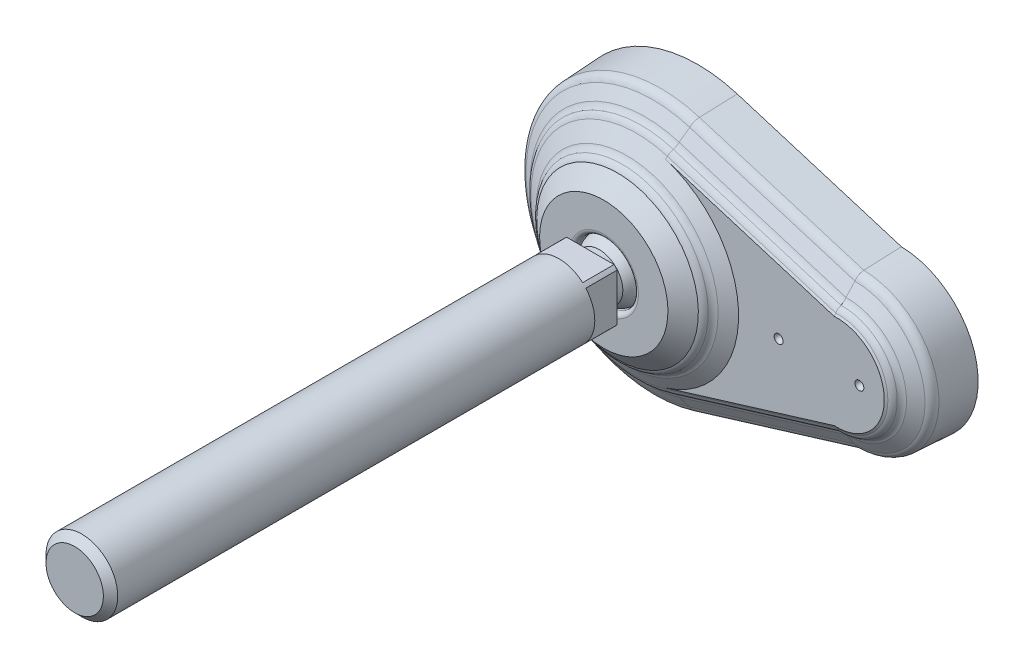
ISO-10303-21;
HEADER;
FILE_DESCRIPTION(('STEP AP214'),'2;1');
FILE_NAME('part.step','',(''),(''),'','','');
FILE_SCHEMA(('AUTOMOTIVE_DESIGN { 1 0 10303 214 1 1 1 1 }'));
ENDSEC;
DATA;
#1=APPLICATION_CONTEXT('core data for automotive mechanical design processes');
#2=APPLICATION_PROTOCOL_DEFINITION('international standard','automotive_design',2000,#1);
#3=PRODUCT_CONTEXT('',#1,'mechanical');
#4=PRODUCT('Part','Part','',(#3));
#5=PRODUCT_RELATED_PRODUCT_CATEGORY('part','',(#4));
#6=PRODUCT_DEFINITION_FORMATION('','',#4);
#7=PRODUCT_DEFINITION_CONTEXT('part definition',#1,'design');
#8=PRODUCT_DEFINITION('design','',#6,#7);
#9=PRODUCT_DEFINITION_SHAPE('','',#8);
#10=(LENGTH_UNIT() NAMED_UNIT(*) SI_UNIT(.MILLI.,.METRE.));
#11=(NAMED_UNIT(*) PLANE_ANGLE_UNIT() SI_UNIT($,.RADIAN.));
#12=(NAMED_UNIT(*) SI_UNIT($,.STERADIAN.) SOLID_ANGLE_UNIT());
#13=UNCERTAINTY_MEASURE_WITH_UNIT(LENGTH_MEASURE(1.E-05),#10,'distance_accuracy_value','');
#14=(GEOMETRIC_REPRESENTATION_CONTEXT(3) GLOBAL_UNCERTAINTY_ASSIGNED_CONTEXT((#13)) GLOBAL_UNIT_ASSIGNED_CONTEXT((#10,
#11,#12)) REPRESENTATION_CONTEXT('',''));
#15=CARTESIAN_POINT('',(0.,0.,0.));
#16=DIRECTION('',(0.,0.,1.));
#17=DIRECTION('',(1.,0.,0.));
#18=AXIS2_PLACEMENT_3D('',#15,#16,#17);
#19=CARTESIAN_POINT('',(0.,0.,33.));
#20=DIRECTION('',(0.,0.,1.));
#21=DIRECTION('',(-1.,0.,0.));
#22=AXIS2_PLACEMENT_3D('',#19,#20,#21);
#23=CYLINDRICAL_SURFACE('',#22,8.);
#24=CARTESIAN_POINT('',(0.,0.,139.4));
#25=DIRECTION('',(0.,0.,1.));
#26=DIRECTION('',(1.,0.,0.));
#27=AXIS2_PLACEMENT_3D('',#24,#25,#26);
#28=CIRCLE('',#27,8.);
#29=CARTESIAN_POINT('',(8.,0.,139.4));
#30=VERTEX_POINT('',#29);
#31=EDGE_CURVE('E9',#30,#30,#28,.F.);
#32=ORIENTED_EDGE('',*,*,#31,.T.);
#33=EDGE_LOOP('',(#32));
#34=FACE_BOUND('',#33,.T.);
#35=DIRECTION('',(0.,0.,1.));
#36=VECTOR('',#35,1.);
#37=CARTESIAN_POINT('',(6.,-5.29150262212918,33.));
#38=LINE('',#37,#36);
#39=CARTESIAN_POINT('',(6.,-5.29150262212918,33.));
#40=VERTEX_POINT('',#39);
#41=CARTESIAN_POINT('',(6.,-5.29150262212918,26.));
#42=VERTEX_POINT('',#41);
#43=EDGE_CURVE('E220',#40,#42,#38,.F.);
#44=ORIENTED_EDGE('',*,*,#43,.F.);
#45=CARTESIAN_POINT('',(0.,0.,33.));
#46=DIRECTION('',(0.,0.,1.));
#47=DIRECTION('',(1.,0.,0.));
#48=AXIS2_PLACEMENT_3D('',#45,#46,#47);
#49=CIRCLE('',#48,8.);
#50=CARTESIAN_POINT('',(6.,5.29150262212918,33.));
#51=VERTEX_POINT('',#50);
#52=EDGE_CURVE('E743',#40,#51,#49,.T.);
#53=ORIENTED_EDGE('',*,*,#52,.T.);
#54=DIRECTION('',(0.,0.,1.));
#55=VECTOR('',#54,1.);
#56=CARTESIAN_POINT('',(6.,5.29150262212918,33.));
#57=LINE('',#56,#55);
#58=CARTESIAN_POINT('',(6.,5.29150262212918,26.));
#59=VERTEX_POINT('',#58);
#60=EDGE_CURVE('E230',#59,#51,#57,.T.);
#61=ORIENTED_EDGE('',*,*,#60,.F.);
#62=CARTESIAN_POINT('',(0.,0.,26.));
#63=DIRECTION('',(0.,0.,1.));
#64=DIRECTION('',(-1.,0.,0.));
#65=AXIS2_PLACEMENT_3D('',#62,#63,#64);
#66=CIRCLE('',#65,8.);
#67=CARTESIAN_POINT('',(5.29150262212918,6.,26.));
#68=VERTEX_POINT('',#67);
#69=EDGE_CURVE('E203',#59,#68,#66,.T.);
#70=ORIENTED_EDGE('',*,*,#69,.T.);
#71=DIRECTION('',(0.,0.,1.));
#72=VECTOR('',#71,1.);
#73=CARTESIAN_POINT('',(5.29150262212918,6.,33.));
#74=LINE('',#73,#72);
#75=CARTESIAN_POINT('',(5.29150262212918,6.,33.));
#76=VERTEX_POINT('',#75);
#77=EDGE_CURVE('E184',#76,#68,#74,.F.);
#78=ORIENTED_EDGE('',*,*,#77,.F.);
#79=CARTESIAN_POINT('',(-5.29150262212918,6.,33.));
#80=VERTEX_POINT('',#79);
#81=EDGE_CURVE('E197',#76,#80,#49,.T.);
#82=ORIENTED_EDGE('',*,*,#81,.T.);
#83=DIRECTION('',(0.,0.,1.));
#84=VECTOR('',#83,1.);
#85=CARTESIAN_POINT('',(-5.29150262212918,6.,33.));
#86=LINE('',#85,#84);
#87=CARTESIAN_POINT('',(-5.29150262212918,6.,26.));
#88=VERTEX_POINT('',#87);
#89=EDGE_CURVE('E182',#88,#80,#86,.T.);
#90=ORIENTED_EDGE('',*,*,#89,.F.);
#91=CARTESIAN_POINT('',(-6.,5.29150262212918,26.));
#92=VERTEX_POINT('',#91);
#93=EDGE_CURVE('E195',#88,#92,#66,.T.);
#94=ORIENTED_EDGE('',*,*,#93,.T.);
#95=DIRECTION('',(0.,0.,1.));
#96=VECTOR('',#95,1.);
#97=CARTESIAN_POINT('',(-6.,5.29150262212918,33.));
#98=LINE('',#97,#96);
#99=CARTESIAN_POINT('',(-6.,5.29150262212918,33.));
#100=VERTEX_POINT('',#99);
#101=EDGE_CURVE('E198',#100,#92,#98,.F.);
#102=ORIENTED_EDGE('',*,*,#101,.F.);
#103=CARTESIAN_POINT('',(-6.,-5.29150262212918,33.));
#104=VERTEX_POINT('',#103);
#105=EDGE_CURVE('E762',#100,#104,#49,.T.);
#106=ORIENTED_EDGE('',*,*,#105,.T.);
#107=DIRECTION('',(0.,0.,1.));
#108=VECTOR('',#107,1.);
#109=CARTESIAN_POINT('',(-6.,-5.29150262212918,33.));
#110=LINE('',#109,#108);
#111=CARTESIAN_POINT('',(-6.,-5.29150262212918,26.));
#112=VERTEX_POINT('',#111);
#113=EDGE_CURVE('E204',#112,#104,#110,.T.);
#114=ORIENTED_EDGE('',*,*,#113,.F.);
#115=CARTESIAN_POINT('',(-5.29150262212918,-6.,26.));
#116=VERTEX_POINT('',#115);
#117=EDGE_CURVE('E206',#112,#116,#66,.T.);
#118=ORIENTED_EDGE('',*,*,#117,.T.);
#119=DIRECTION('',(0.,0.,1.));
#120=VECTOR('',#119,1.);
#121=CARTESIAN_POINT('',(-5.29150262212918,-6.,33.));
#122=LINE('',#121,#120);
#123=CARTESIAN_POINT('',(-5.29150262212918,-6.,33.));
#124=VERTEX_POINT('',#123);
#125=EDGE_CURVE('E159',#124,#116,#122,.F.);
#126=ORIENTED_EDGE('',*,*,#125,.F.);
#127=CARTESIAN_POINT('',(5.29150262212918,-6.,33.));
#128=VERTEX_POINT('',#127);
#129=EDGE_CURVE('E760',#124,#128,#49,.T.);
#130=ORIENTED_EDGE('',*,*,#129,.T.);
#131=DIRECTION('',(0.,0.,1.));
#132=VECTOR('',#131,1.);
#133=CARTESIAN_POINT('',(5.29150262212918,-6.,33.));
#134=LINE('',#133,#132);
#135=CARTESIAN_POINT('',(5.29150262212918,-6.,26.));
#136=VERTEX_POINT('',#135);
#137=EDGE_CURVE('E223',#136,#128,#134,.T.);
#138=ORIENTED_EDGE('',*,*,#137,.F.);
#139=EDGE_CURVE('E207',#136,#42,#66,.T.);
#140=ORIENTED_EDGE('',*,*,#139,.T.);
#141=EDGE_LOOP('',(#44,#53,#61,#70,#78,#82,#90,#94,#102,#106,#114,#118,#126,#130,#138,#140));
#142=FACE_BOUND('',#141,.T.);
#143=ADVANCED_FACE('F15',(#34,#142),#23,.T.);
#144=CARTESIAN_POINT('',(-5.24903501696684,0.,26.));
#145=DIRECTION('',(0.,0.,1.));
#146=DIRECTION('',(-1.,0.,0.));
#147=AXIS2_PLACEMENT_3D('',#144,#145,#146);
#148=PLANE('',#147);
#149=DIRECTION('',(0.,-1.,0.));
#150=VECTOR('',#149,1.);
#151=CARTESIAN_POINT('',(-6.,0.,26.));
#152=LINE('',#151,#150);
#153=EDGE_CURVE('E32',#92,#112,#152,.T.);
#154=ORIENTED_EDGE('',*,*,#153,.F.);
#155=ORIENTED_EDGE('',*,*,#93,.F.);
#156=DIRECTION('',(-1.,0.,0.));
#157=VECTOR('',#156,1.);
#158=CARTESIAN_POINT('',(-5.24903501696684,6.,26.));
#159=LINE('',#158,#157);
#160=EDGE_CURVE('E177',#68,#88,#159,.T.);
#161=ORIENTED_EDGE('',*,*,#160,.F.);
#162=ORIENTED_EDGE('',*,*,#69,.F.);
#163=DIRECTION('',(0.,1.,0.));
#164=VECTOR('',#163,1.);
#165=CARTESIAN_POINT('',(6.,0.,26.));
#166=LINE('',#165,#164);
#167=EDGE_CURVE('E226',#42,#59,#166,.T.);
#168=ORIENTED_EDGE('',*,*,#167,.F.);
#169=ORIENTED_EDGE('',*,*,#139,.F.);
#170=DIRECTION('',(1.,0.,0.));
#171=VECTOR('',#170,1.);
#172=CARTESIAN_POINT('',(-5.24903501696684,-6.,26.));
#173=LINE('',#172,#171);
#174=EDGE_CURVE('E225',#116,#136,#173,.T.);
#175=ORIENTED_EDGE('',*,*,#174,.F.);
#176=ORIENTED_EDGE('',*,*,#117,.F.);
#177=EDGE_LOOP('',(#154,#155,#161,#162,#168,#169,#175,#176));
#178=FACE_BOUND('',#177,.T.);
#179=CARTESIAN_POINT('',(0.,0.,26.));
#180=DIRECTION('',(0.,0.,1.));
#181=DIRECTION('',(-1.,0.,0.));
#182=AXIS2_PLACEMENT_3D('',#179,#180,#181);
#183=CIRCLE('',#182,5.24903501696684);
#184=CARTESIAN_POINT('',(-5.24903501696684,0.,26.));
#185=VERTEX_POINT('',#184);
#186=EDGE_CURVE('E212',#185,#185,#183,.T.);
#187=ORIENTED_EDGE('',*,*,#186,.T.);
#188=EDGE_LOOP('',(#187));
#189=FACE_BOUND('',#188,.T.);
#190=ADVANCED_FACE('F200',(#178,#189),#148,.F.);
#191=CARTESIAN_POINT('',(0.,0.,19.6309999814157));
#192=DIRECTION('',(0.,0.,1.));
#193=DIRECTION('',(-1.,0.,0.));
#194=AXIS2_PLACEMENT_3D('',#191,#192,#193);
#195=DEGENERATE_TOROIDAL_SURFACE('',#194,0.0005038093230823,6.829,.T.);
#196=CARTESIAN_POINT('',(0.,0.,20.775));
#197=DIRECTION('',(0.,0.,-1.));
#198=DIRECTION('',(1.,0.,0.));
#199=AXIS2_PLACEMENT_3D('',#196,#197,#198);
#200=CIRCLE('',#199,6.733);
#201=CARTESIAN_POINT('',(6.733,0.,20.775));
#202=VERTEX_POINT('',#201);
#203=EDGE_CURVE('E247',#202,#202,#200,.T.);
#204=ORIENTED_EDGE('',*,*,#203,.F.);
#205=EDGE_LOOP('',(#204));
#206=FACE_BOUND('',#205,.T.);
#207=CARTESIAN_POINT('',(0.,0.,24.));
#208=DIRECTION('',(0.,0.,1.));
#209=DIRECTION('',(-1.,0.,0.));
#210=AXIS2_PLACEMENT_3D('',#207,#208,#209);
#211=CIRCLE('',#210,5.24903501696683);
#212=CARTESIAN_POINT('',(-5.24903501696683,0.,24.));
#213=VERTEX_POINT('',#212);
#214=EDGE_CURVE('E214',#213,#213,#211,.T.);
#215=ORIENTED_EDGE('',*,*,#214,.F.);
#216=EDGE_LOOP('',(#215));
#217=FACE_BOUND('',#216,.T.);
#218=ADVANCED_FACE('F508',(#206,#217),#195,.T.);
#219=CARTESIAN_POINT('',(0.,0.,33.));
#220=DIRECTION('',(0.,0.,1.));
#221=DIRECTION('',(-1.,0.,0.));
#222=AXIS2_PLACEMENT_3D('',#219,#220,#221);
#223=CYLINDRICAL_SURFACE('',#222,5.24903501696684);
#224=ORIENTED_EDGE('',*,*,#186,.F.);
#225=EDGE_LOOP('',(#224));
#226=FACE_BOUND('',#225,.T.);
#227=ORIENTED_EDGE('',*,*,#214,.T.);
#228=EDGE_LOOP('',(#227));
#229=FACE_BOUND('',#228,.T.);
#230=ADVANCED_FACE('F768',(#226,#229),#223,.T.);
#231=CARTESIAN_POINT('',(-6.,-6.,25.));
#232=DIRECTION('',(0.,-1.,0.));
#233=DIRECTION('',(1.,0.,0.));
#234=AXIS2_PLACEMENT_3D('',#231,#232,#233);
#235=PLANE('',#234);
#236=ORIENTED_EDGE('',*,*,#137,.T.);
#237=DIRECTION('',(-1.,0.,0.));
#238=VECTOR('',#237,1.);
#239=CARTESIAN_POINT('',(-8.,-6.,33.));
#240=LINE('',#239,#238);
#241=EDGE_CURVE('E714',#128,#124,#240,.T.);
#242=ORIENTED_EDGE('',*,*,#241,.T.);
#243=ORIENTED_EDGE('',*,*,#125,.T.);
#244=ORIENTED_EDGE('',*,*,#174,.T.);
#245=EDGE_LOOP('',(#236,#242,#243,#244));
#246=FACE_BOUND('',#245,.T.);
#247=ADVANCED_FACE('F764',(#246),#235,.T.);
#248=CARTESIAN_POINT('',(6.,-6.,25.));
#249=DIRECTION('',(1.,0.,0.));
#250=DIRECTION('',(0.,1.,0.));
#251=AXIS2_PLACEMENT_3D('',#248,#249,#250);
#252=PLANE('',#251);
#253=ORIENTED_EDGE('',*,*,#60,.T.);
#254=DIRECTION('',(0.,-1.,0.));
#255=VECTOR('',#254,1.);
#256=CARTESIAN_POINT('',(6.,0.,33.));
#257=LINE('',#256,#255);
#258=EDGE_CURVE('E721',#51,#40,#257,.T.);
#259=ORIENTED_EDGE('',*,*,#258,.T.);
#260=ORIENTED_EDGE('',*,*,#43,.T.);
#261=ORIENTED_EDGE('',*,*,#167,.T.);
#262=EDGE_LOOP('',(#253,#259,#260,#261));
#263=FACE_BOUND('',#262,.T.);
#264=ADVANCED_FACE('F744',(#263),#252,.T.);
#265=CARTESIAN_POINT('',(6.,6.,25.));
#266=DIRECTION('',(0.,1.,0.));
#267=DIRECTION('',(-1.,0.,0.));
#268=AXIS2_PLACEMENT_3D('',#265,#266,#267);
#269=PLANE('',#268);
#270=ORIENTED_EDGE('',*,*,#89,.T.);
#271=DIRECTION('',(1.,0.,0.));
#272=VECTOR('',#271,1.);
#273=CARTESIAN_POINT('',(-8.,6.,33.));
#274=LINE('',#273,#272);
#275=EDGE_CURVE('E254',#80,#76,#274,.T.);
#276=ORIENTED_EDGE('',*,*,#275,.T.);
#277=ORIENTED_EDGE('',*,*,#77,.T.);
#278=ORIENTED_EDGE('',*,*,#160,.T.);
#279=EDGE_LOOP('',(#270,#276,#277,#278));
#280=FACE_BOUND('',#279,.T.);
#281=ADVANCED_FACE('F179',(#280),#269,.T.);
#282=CARTESIAN_POINT('',(-6.,6.,25.));
#283=DIRECTION('',(-1.,0.,0.));
#284=DIRECTION('',(0.,-1.,0.));
#285=AXIS2_PLACEMENT_3D('',#282,#283,#284);
#286=PLANE('',#285);
#287=ORIENTED_EDGE('',*,*,#113,.T.);
#288=DIRECTION('',(0.,1.,0.));
#289=VECTOR('',#288,1.);
#290=CARTESIAN_POINT('',(-6.,0.,33.));
#291=LINE('',#290,#289);
#292=EDGE_CURVE('E240',#104,#100,#291,.T.);
#293=ORIENTED_EDGE('',*,*,#292,.T.);
#294=ORIENTED_EDGE('',*,*,#101,.T.);
#295=ORIENTED_EDGE('',*,*,#153,.T.);
#296=EDGE_LOOP('',(#287,#293,#294,#295));
#297=FACE_BOUND('',#296,.T.);
#298=ADVANCED_FACE('F782',(#297),#286,.T.);
#299=CARTESIAN_POINT('',(0.,0.,0.));
#300=DIRECTION('',(0.,0.,1.));
#301=DIRECTION('',(0.,-1.,0.));
#302=AXIS2_PLACEMENT_3D('',#299,#300,#301);
#303=PLANE('',#302);
#304=DIRECTION('',(-0.950373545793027,0.311111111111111,0.));
#305=VECTOR('',#304,1.);
#306=CARTESIAN_POINT('',(48.7333333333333,11.4044825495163,0.));
#307=LINE('',#306,#305);
#308=CARTESIAN_POINT('',(48.7333333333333,11.4044825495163,0.));
#309=VERTEX_POINT('',#308);
#310=CARTESIAN_POINT('',(8.08888888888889,24.7097121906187,0.));
#311=VERTEX_POINT('',#310);
#312=EDGE_CURVE('E258',#309,#311,#307,.T.);
#313=ORIENTED_EDGE('',*,*,#312,.F.);
#314=CARTESIAN_POINT('',(45.,0.,0.));
#315=DIRECTION('',(0.,0.,1.));
#316=DIRECTION('',(1.,0.,0.));
#317=AXIS2_PLACEMENT_3D('',#314,#315,#316);
#318=CIRCLE('',#317,12.);
#319=CARTESIAN_POINT('',(48.7333333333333,-11.4044825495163,0.));
#320=VERTEX_POINT('',#319);
#321=EDGE_CURVE('E268',#320,#309,#318,.T.);
#322=ORIENTED_EDGE('',*,*,#321,.F.);
#323=DIRECTION('',(0.950373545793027,0.311111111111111,0.));
#324=VECTOR('',#323,1.);
#325=CARTESIAN_POINT('',(8.08888888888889,-24.7097121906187,0.));
#326=LINE('',#325,#324);
#327=CARTESIAN_POINT('',(8.08888888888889,-24.7097121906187,0.));
#328=VERTEX_POINT('',#327);
#329=EDGE_CURVE('E265',#328,#320,#326,.T.);
#330=ORIENTED_EDGE('',*,*,#329,.F.);
#331=CARTESIAN_POINT('',(0.,0.,0.));
#332=DIRECTION('',(0.,0.,1.));
#333=DIRECTION('',(1.,0.,0.));
#334=AXIS2_PLACEMENT_3D('',#331,#332,#333);
#335=CIRCLE('',#334,26.);
#336=EDGE_CURVE('E261',#311,#328,#335,.T.);
#337=ORIENTED_EDGE('',*,*,#336,.F.);
#338=EDGE_LOOP('',(#313,#322,#330,#337));
#339=FACE_BOUND('',#338,.T.);
#340=ADVANCED_FACE('F510',(#339),#303,.F.);
#341=CARTESIAN_POINT('',(8.08888888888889,-24.7097121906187,0.));
#342=DIRECTION('',(0.311111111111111,-0.950373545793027,0.));
#343=DIRECTION('',(0.950373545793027,0.311111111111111,0.));
#344=AXIS2_PLACEMENT_3D('',#341,#342,#343);
#345=PLANE('',#344);
#346=DIRECTION('',(0.950373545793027,0.311111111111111,0.));
#347=VECTOR('',#346,1.);
#348=CARTESIAN_POINT('',(8.08888888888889,-24.7097121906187,2.));
#349=LINE('',#348,#347);
#350=CARTESIAN_POINT('',(8.08888888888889,-24.7097121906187,2.));
#351=VERTEX_POINT('',#350);
#352=CARTESIAN_POINT('',(48.7333333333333,-11.4044825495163,2.));
#353=VERTEX_POINT('',#352);
#354=EDGE_CURVE('E276',#351,#353,#349,.T.);
#355=ORIENTED_EDGE('',*,*,#354,.F.);
#356=DIRECTION('',(0.,0.,1.));
#357=VECTOR('',#356,1.);
#358=CARTESIAN_POINT('',(8.08888888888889,-24.7097121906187,0.));
#359=LINE('',#358,#357);
#360=EDGE_CURVE('E284',#328,#351,#359,.T.);
#361=ORIENTED_EDGE('',*,*,#360,.F.);
#362=ORIENTED_EDGE('',*,*,#329,.T.);
#363=DIRECTION('',(0.,0.,1.));
#364=VECTOR('',#363,1.);
#365=CARTESIAN_POINT('',(48.7333333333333,-11.4044825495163,0.));
#366=LINE('',#365,#364);
#367=EDGE_CURVE('E282',#320,#353,#366,.T.);
#368=ORIENTED_EDGE('',*,*,#367,.T.);
#369=EDGE_LOOP('',(#355,#361,#362,#368));
#370=FACE_BOUND('',#369,.T.);
#371=ADVANCED_FACE('F781',(#370),#345,.T.);
#372=CARTESIAN_POINT('',(0.,0.,0.));
#373=DIRECTION('',(0.,0.,1.));
#374=DIRECTION('',(0.,-1.,0.));
#375=AXIS2_PLACEMENT_3D('',#372,#373,#374);
#376=CYLINDRICAL_SURFACE('',#375,26.);
#377=CARTESIAN_POINT('',(0.,0.,2.));
#378=DIRECTION('',(0.,0.,1.));
#379=DIRECTION('',(1.,0.,0.));
#380=AXIS2_PLACEMENT_3D('',#377,#378,#379);
#381=CIRCLE('',#380,26.);
#382=CARTESIAN_POINT('',(8.08888888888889,24.7097121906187,2.));
#383=VERTEX_POINT('',#382);
#384=EDGE_CURVE('E273',#383,#351,#381,.T.);
#385=ORIENTED_EDGE('',*,*,#384,.F.);
#386=DIRECTION('',(0.,0.,1.));
#387=VECTOR('',#386,1.);
#388=CARTESIAN_POINT('',(8.08888888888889,24.7097121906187,0.));
#389=LINE('',#388,#387);
#390=EDGE_CURVE('E286',#311,#383,#389,.T.);
#391=ORIENTED_EDGE('',*,*,#390,.F.);
#392=ORIENTED_EDGE('',*,*,#336,.T.);
#393=ORIENTED_EDGE('',*,*,#360,.T.);
#394=EDGE_LOOP('',(#385,#391,#392,#393));
#395=FACE_BOUND('',#394,.T.);
#396=ADVANCED_FACE('F797',(#395),#376,.T.);
#397=CARTESIAN_POINT('',(48.7333333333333,11.4044825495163,0.));
#398=DIRECTION('',(0.311111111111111,0.950373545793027,0.));
#399=DIRECTION('',(-0.950373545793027,0.311111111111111,0.));
#400=AXIS2_PLACEMENT_3D('',#397,#398,#399);
#401=PLANE('',#400);
#402=DIRECTION('',(-0.950373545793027,0.311111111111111,0.));
#403=VECTOR('',#402,1.);
#404=CARTESIAN_POINT('',(48.7333333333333,11.4044825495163,2.));
#405=LINE('',#404,#403);
#406=CARTESIAN_POINT('',(48.7333333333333,11.4044825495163,2.));
#407=VERTEX_POINT('',#406);
#408=EDGE_CURVE('E150',#407,#383,#405,.T.);
#409=ORIENTED_EDGE('',*,*,#408,.F.);
#410=DIRECTION('',(0.,0.,1.));
#411=VECTOR('',#410,1.);
#412=CARTESIAN_POINT('',(48.7333333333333,11.4044825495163,0.));
#413=LINE('',#412,#411);
#414=EDGE_CURVE('E271',#309,#407,#413,.T.);
#415=ORIENTED_EDGE('',*,*,#414,.F.);
#416=ORIENTED_EDGE('',*,*,#312,.T.);
#417=ORIENTED_EDGE('',*,*,#390,.T.);
#418=EDGE_LOOP('',(#409,#415,#416,#417));
#419=FACE_BOUND('',#418,.T.);
#420=ADVANCED_FACE('F532',(#419),#401,.T.);
#421=CARTESIAN_POINT('',(45.,0.,0.));
#422=DIRECTION('',(0.,0.,1.));
#423=DIRECTION('',(0.,-1.,0.));
#424=AXIS2_PLACEMENT_3D('',#421,#422,#423);
#425=CYLINDRICAL_SURFACE('',#424,12.);
#426=CARTESIAN_POINT('',(45.,0.,2.));
#427=DIRECTION('',(0.,0.,1.));
#428=DIRECTION('',(1.,0.,0.));
#429=AXIS2_PLACEMENT_3D('',#426,#427,#428);
#430=CIRCLE('',#429,12.);
#431=EDGE_CURVE('E262',#353,#407,#430,.T.);
#432=ORIENTED_EDGE('',*,*,#431,.F.);
#433=ORIENTED_EDGE('',*,*,#367,.F.);
#434=ORIENTED_EDGE('',*,*,#321,.T.);
#435=ORIENTED_EDGE('',*,*,#414,.T.);
#436=EDGE_LOOP('',(#432,#433,#434,#435));
#437=FACE_BOUND('',#436,.T.);
#438=ADVANCED_FACE('F518',(#437),#425,.T.);
#439=CARTESIAN_POINT('',(45.,0.,2.));
#440=DIRECTION('',(0.,0.,-1.));
#441=DIRECTION('',(0.,1.,0.));
#442=AXIS2_PLACEMENT_3D('',#439,#440,#441);
#443=CONICAL_SURFACE('',#442,17.5,0.0523365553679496);
#444=CARTESIAN_POINT('',(45.,0.,10.304));
#445=DIRECTION('',(0.,0.,1.));
#446=DIRECTION('',(0.,-1.,0.));
#447=AXIS2_PLACEMENT_3D('',#444,#445,#446);
#448=CIRCLE('',#447,17.065);
#449=CARTESIAN_POINT('',(45.3136024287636,-17.0621182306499,10.304));
#450=VERTEX_POINT('',#449);
#451=CARTESIAN_POINT('',(45.3136024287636,17.0621182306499,10.304));
#452=VERTEX_POINT('',#451);
#453=EDGE_CURVE('E335',#450,#452,#448,.T.);
#454=ORIENTED_EDGE('',*,*,#453,.F.);
#455=CARTESIAN_POINT('',(45.3136007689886,-17.0621077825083,10.3042));
#456=CARTESIAN_POINT('',(45.3250873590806,-17.134412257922,8.92013380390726));
#457=CARTESIAN_POINT('',(45.3366049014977,-17.206707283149,7.5360673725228));
#458=CARTESIAN_POINT('',(45.3597018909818,-17.3512784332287,4.76793403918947));
#459=CARTESIAN_POINT('',(45.3712813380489,-17.4235545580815,3.38386713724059));
#460=CARTESIAN_POINT('',(45.3828917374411,-17.4958212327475,1.9998));
#461=B_SPLINE_CURVE_WITH_KNOTS('',3,(#455,#456,#457,#458,#459,#460),.UNSPECIFIED.,.F.,.F.,(4,2,
4),(0.,4.15800336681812,8.31600673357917),.UNSPECIFIED.);
#462=CARTESIAN_POINT('',(45.3828900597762,-17.4958107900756,2.));
#463=VERTEX_POINT('',#462);
#464=EDGE_CURVE('E644',#450,#463,#461,.T.);
#465=ORIENTED_EDGE('',*,*,#464,.T.);
#466=CARTESIAN_POINT('',(45.,0.,2.));
#467=DIRECTION('',(0.,0.,1.));
#468=DIRECTION('',(0.,-1.,0.));
#469=AXIS2_PLACEMENT_3D('',#466,#467,#468);
#470=CIRCLE('',#469,17.5);
#471=CARTESIAN_POINT('',(45.3828900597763,17.4958107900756,2.));
#472=VERTEX_POINT('',#471);
#473=EDGE_CURVE('E338',#463,#472,#470,.T.);
#474=ORIENTED_EDGE('',*,*,#473,.T.);
#475=CARTESIAN_POINT('',(45.3828917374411,17.4958212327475,1.9998));
#476=CARTESIAN_POINT('',(45.371281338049,17.4235545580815,3.38386713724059));
#477=CARTESIAN_POINT('',(45.359701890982,17.3512784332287,4.76793403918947));
#478=CARTESIAN_POINT('',(45.3366049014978,17.206707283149,7.5360673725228));
#479=CARTESIAN_POINT('',(45.3250873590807,17.134412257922,8.92013380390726));
#480=CARTESIAN_POINT('',(45.3136007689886,17.0621077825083,10.3042));
#481=B_SPLINE_CURVE_WITH_KNOTS('',3,(#475,#476,#477,#478,#479,#480),.UNSPECIFIED.,.F.,.F.,(4,2,
4),(0.,4.15800336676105,8.31600673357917),.UNSPECIFIED.);
#482=EDGE_CURVE('E660',#472,#452,#481,.T.);
#483=ORIENTED_EDGE('',*,*,#482,.T.);
#484=EDGE_LOOP('',(#454,#465,#474,#483));
#485=FACE_BOUND('',#484,.T.);
#486=ADVANCED_FACE('F398',(#485),#443,.T.);
#487=CARTESIAN_POINT('',(46.8961596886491,-16.5782819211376,10.304));
#488=DIRECTION('',(-0.291971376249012,0.9549953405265,-0.0523126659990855));
#489=DIRECTION('',(-0.956304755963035,-0.292371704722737,0.));
#490=AXIS2_PLACEMENT_3D('',#487,#488,#489);
#491=PLANE('',#490);
#492=ORIENTED_EDGE('',*,*,#464,.F.);
#493=DIRECTION('',(-0.956304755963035,-0.292371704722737,0.));
#494=VECTOR('',#493,1.);
#495=CARTESIAN_POINT('',(46.8961596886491,-16.5782819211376,10.304));
#496=LINE('',#495,#494);
#497=CARTESIAN_POINT('',(8.64396945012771,-28.2731501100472,10.304));
#498=VERTEX_POINT('',#497);
#499=EDGE_CURVE('E592',#450,#498,#496,.T.);
#500=ORIENTED_EDGE('',*,*,#499,.T.);
#501=DIRECTION('',(-0.0152947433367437,0.050026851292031,0.998630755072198));
#502=VECTOR('',#501,1.);
#503=CARTESIAN_POINT('',(8.7711511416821,-28.689142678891,2.));
#504=LINE('',#503,#502);
#505=CARTESIAN_POINT('',(8.7711511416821,-28.689142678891,2.));
#506=VERTEX_POINT('',#505);
#507=EDGE_CURVE('E598',#506,#498,#504,.T.);
#508=ORIENTED_EDGE('',*,*,#507,.F.);
#509=DIRECTION('',(-0.956304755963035,-0.292371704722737,0.));
#510=VECTOR('',#509,1.);
#511=CARTESIAN_POINT('',(47.0233413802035,-16.9942744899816,2.));
#512=LINE('',#511,#510);
#513=EDGE_CURVE('E144',#463,#506,#512,.T.);
#514=ORIENTED_EDGE('',*,*,#513,.F.);
#515=EDGE_LOOP('',(#492,#500,#508,#514));
#516=FACE_BOUND('',#515,.T.);
#517=ADVANCED_FACE('F504',(#516),#491,.F.);
#518=CARTESIAN_POINT('',(0.,0.,2.));
#519=DIRECTION('',(0.,0.,1.));
#520=DIRECTION('',(0.,-1.,0.));
#521=AXIS2_PLACEMENT_3D('',#518,#519,#520);
#522=PLANE('',#521);
#523=ORIENTED_EDGE('',*,*,#431,.T.);
#524=ORIENTED_EDGE('',*,*,#408,.T.);
#525=ORIENTED_EDGE('',*,*,#384,.T.);
#526=ORIENTED_EDGE('',*,*,#354,.T.);
#527=EDGE_LOOP('',(#523,#524,#525,#526));
#528=FACE_BOUND('',#527,.T.);
#529=DIRECTION('',(-0.956304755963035,0.292371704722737,0.));
#530=VECTOR('',#529,1.);
#531=CARTESIAN_POINT('',(47.0233413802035,16.9942744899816,2.));
#532=LINE('',#531,#530);
#533=CARTESIAN_POINT('',(8.7711511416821,28.689142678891,2.));
#534=VERTEX_POINT('',#533);
#535=EDGE_CURVE('E647',#472,#534,#532,.T.);
#536=ORIENTED_EDGE('',*,*,#535,.F.);
#537=ORIENTED_EDGE('',*,*,#473,.F.);
#538=ORIENTED_EDGE('',*,*,#513,.T.);
#539=CARTESIAN_POINT('',(0.,0.,2.));
#540=DIRECTION('',(0.,0.,1.));
#541=DIRECTION('',(0.,-1.,0.));
#542=AXIS2_PLACEMENT_3D('',#539,#540,#541);
#543=CIRCLE('',#542,30.);
#544=EDGE_CURVE('E386',#534,#506,#543,.T.);
#545=ORIENTED_EDGE('',*,*,#544,.F.);
#546=EDGE_LOOP('',(#536,#537,#538,#545));
#547=FACE_BOUND('',#546,.T.);
#548=ADVANCED_FACE('F396',(#528,#547),#522,.F.);
#549=CARTESIAN_POINT('',(47.0233413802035,16.9942744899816,2.));
#550=DIRECTION('',(-0.291971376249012,-0.9549953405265,-0.0523126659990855));
#551=DIRECTION('',(0.956304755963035,-0.292371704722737,0.));
#552=AXIS2_PLACEMENT_3D('',#549,#550,#551);
#553=PLANE('',#552);
#554=ORIENTED_EDGE('',*,*,#482,.F.);
#555=ORIENTED_EDGE('',*,*,#535,.T.);
#556=DIRECTION('',(-0.0152947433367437,-0.050026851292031,0.998630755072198));
#557=VECTOR('',#556,1.);
#558=CARTESIAN_POINT('',(8.7711511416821,28.689142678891,2.));
#559=LINE('',#558,#557);
#560=CARTESIAN_POINT('',(8.64396945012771,28.2731501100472,10.304));
#561=VERTEX_POINT('',#560);
#562=EDGE_CURVE('E612',#534,#561,#559,.T.);
#563=ORIENTED_EDGE('',*,*,#562,.T.);
#564=DIRECTION('',(-0.956304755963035,0.292371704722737,0.));
#565=VECTOR('',#564,1.);
#566=CARTESIAN_POINT('',(46.8961596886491,16.5782819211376,10.304));
#567=LINE('',#566,#565);
#568=EDGE_CURVE('E648',#452,#561,#567,.T.);
#569=ORIENTED_EDGE('',*,*,#568,.F.);
#570=EDGE_LOOP('',(#554,#555,#563,#569));
#571=FACE_BOUND('',#570,.T.);
#572=ADVANCED_FACE('F474',(#571),#553,.F.);
#573=CARTESIAN_POINT('',(45.,0.,10.2086896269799));
#574=DIRECTION('',(0.,0.,1.));
#575=DIRECTION('',(0.,-1.,0.));
#576=AXIS2_PLACEMENT_3D('',#573,#574,#575);
#577=TOROIDAL_SURFACE('',#576,15.0672723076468,2.);
#578=CARTESIAN_POINT('',(45.313603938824,-17.062127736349,10.3038));
#579=CARTESIAN_POINT('',(45.3131828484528,-17.0594763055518,10.3596419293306));
#580=CARTESIAN_POINT('',(45.3123906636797,-17.0544900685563,10.4153431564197));
#581=CARTESIAN_POINT('',(45.3100724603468,-17.0398916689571,10.5261166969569));
#582=CARTESIAN_POINT('',(45.3085464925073,-17.0302798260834,10.5811890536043));
#583=CARTESIAN_POINT('',(45.3028875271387,-16.9946160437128,10.7447437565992));
#584=CARTESIAN_POINT('',(45.2976717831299,-16.9617253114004,10.8517806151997));
#585=CARTESIAN_POINT('',(45.284530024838,-16.8786837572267,11.0587251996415));
#586=CARTESIAN_POINT('',(45.2766032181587,-16.8285278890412,11.1586308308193));
#587=CARTESIAN_POINT('',(45.2583029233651,-16.7124179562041,11.348570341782));
#588=CARTESIAN_POINT('',(45.24792931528,-16.6464631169,11.4386037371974));
#589=CARTESIAN_POINT('',(45.2250216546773,-16.5003240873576,11.6067133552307));
#590=CARTESIAN_POINT('',(45.2124772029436,-16.4200713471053,11.684728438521));
#591=CARTESIAN_POINT('',(45.1856662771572,-16.2478592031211,11.8261370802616));
#592=CARTESIAN_POINT('',(45.1714009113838,-16.1559073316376,11.8895399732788));
#593=CARTESIAN_POINT('',(45.148748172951,-16.0092275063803,11.9735680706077));
#594=CARTESIAN_POINT('',(45.1408156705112,-15.957749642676,12.0001426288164));
#595=CARTESIAN_POINT('',(45.1246863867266,-15.8528232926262,12.0486569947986));
#596=CARTESIAN_POINT('',(45.1164901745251,-15.7993790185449,12.0706061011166));
#597=CARTESIAN_POINT('',(45.1081834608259,-15.7450737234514,12.0902));
#598=B_SPLINE_CURVE_WITH_KNOTS('',3,(#578,#579,#580,#581,#582,#583,#584,#585,#586,#587,#588,
#589,#590,#591,#592,#593,#594,#595,#596,#597),.UNSPECIFIED.,.F.,.F.,(4,2,2,2,2,2,2,2,2,4),(0.,
0.167615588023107,0.335219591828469,0.669784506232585,1.00444729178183,1.33912648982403,
1.67545571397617,2.01156948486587,2.1867983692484,2.36167155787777),.UNSPECIFIED.);
#599=CARTESIAN_POINT('',(45.108268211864,-15.7456277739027,12.09));
#600=VERTEX_POINT('',#599);
#601=EDGE_CURVE('E666',#450,#600,#598,.T.);
#602=ORIENTED_EDGE('',*,*,#601,.F.);
#603=ORIENTED_EDGE('',*,*,#453,.T.);
#604=CARTESIAN_POINT('',(45.1081834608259,15.7450737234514,12.0902));
#605=CARTESIAN_POINT('',(45.1162755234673,15.7979756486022,12.0711117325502));
#606=CARTESIAN_POINT('',(45.1242625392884,15.8500594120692,12.0497900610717));
#607=CARTESIAN_POINT('',(45.1399729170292,15.9522733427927,12.0028085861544));
#608=CARTESIAN_POINT('',(45.1476962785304,16.0024035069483,11.9771487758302));
#609=CARTESIAN_POINT('',(45.170371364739,16.1492634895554,11.8939254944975));
#610=CARTESIAN_POINT('',(45.1848488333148,16.2425982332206,11.8300692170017));
#611=CARTESIAN_POINT('',(45.2120467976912,16.4173167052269,11.6873614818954));
#612=CARTESIAN_POINT('',(45.2247661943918,16.4986929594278,11.6085007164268));
#613=CARTESIAN_POINT('',(45.2480269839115,16.647087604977,11.4379734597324));
#614=CARTESIAN_POINT('',(45.2585686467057,16.7141077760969,11.3463085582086));
#615=CARTESIAN_POINT('',(45.2770522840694,16.8313730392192,11.1534556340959));
#616=CARTESIAN_POINT('',(45.2850114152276,16.8817288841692,11.0523364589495));
#617=CARTESIAN_POINT('',(45.298151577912,16.9647535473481,10.8429463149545));
#618=CARTESIAN_POINT('',(45.3033350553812,16.9974379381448,10.7346817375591));
#619=CARTESIAN_POINT('',(45.3088197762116,17.0320013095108,10.5716792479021));
#620=CARTESIAN_POINT('',(45.3102579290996,17.0410597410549,10.5184099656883));
#621=CARTESIAN_POINT('',(45.3124461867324,17.0548396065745,10.411403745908));
#622=CARTESIAN_POINT('',(45.3131976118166,17.0595693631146,10.3576679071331));
#623=CARTESIAN_POINT('',(45.313603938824,17.062127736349,10.3038));
#624=B_SPLINE_CURVE_WITH_KNOTS('',3,(#604,#605,#606,#607,#608,#609,#610,#611,#612,#613,#614,
#615,#616,#617,#618,#619,#620,#621,#622,#623),.UNSPECIFIED.,.F.,.F.,(4,2,2,2,2,2,2,2,2,4),(0.,
0.170355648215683,0.340711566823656,0.680992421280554,1.02148505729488,1.36193545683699,
1.70007548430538,2.03791704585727,2.19992239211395,2.36161559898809),.UNSPECIFIED.);
#625=CARTESIAN_POINT('',(45.1082682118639,15.7456277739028,12.09));
#626=VERTEX_POINT('',#625);
#627=EDGE_CURVE('E463',#626,#452,#624,.T.);
#628=ORIENTED_EDGE('',*,*,#627,.F.);
#629=CARTESIAN_POINT('',(45.,0.,12.09));
#630=DIRECTION('',(0.,0.,1.));
#631=DIRECTION('',(0.,-1.,0.));
#632=AXIS2_PLACEMENT_3D('',#629,#630,#631);
#633=CIRCLE('',#632,15.746);
#634=EDGE_CURVE('E332',#600,#626,#633,.T.);
#635=ORIENTED_EDGE('',*,*,#634,.F.);
#636=EDGE_LOOP('',(#602,#603,#628,#635));
#637=FACE_BOUND('',#636,.T.);
#638=ADVANCED_FACE('F447',(#637),#577,.T.);
#639=CARTESIAN_POINT('',(46.312080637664,-14.6678454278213,10.2086896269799));
#640=DIRECTION('',(-0.956304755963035,-0.292371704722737,0.));
#641=DIRECTION('',(0.292371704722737,-0.956304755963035,0.));
#642=AXIS2_PLACEMENT_3D('',#639,#640,#641);
#643=CYLINDRICAL_SURFACE('',#642,2.);
#644=ORIENTED_EDGE('',*,*,#499,.F.);
#645=ORIENTED_EDGE('',*,*,#601,.T.);
#646=DIRECTION('',(-0.956304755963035,-0.292371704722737,0.));
#647=VECTOR('',#646,1.);
#648=CARTESIAN_POINT('',(46.5105214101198,-15.3169159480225,12.09));
#649=LINE('',#648,#647);
#650=CARTESIAN_POINT('',(8.25833117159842,-27.0117841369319,12.09));
#651=VERTEX_POINT('',#650);
#652=EDGE_CURVE('E589',#600,#651,#649,.T.);
#653=ORIENTED_EDGE('',*,*,#652,.T.);
#654=CARTESIAN_POINT('',(8.05989039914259,-26.3627136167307,10.2086896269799));
#655=DIRECTION('',(0.956304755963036,0.292371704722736,0.));
#656=DIRECTION('',(-0.292371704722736,0.956304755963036,0.));
#657=AXIS2_PLACEMENT_3D('',#654,#655,#656);
#658=CIRCLE('',#657,2.);
#659=EDGE_CURVE('E601',#651,#498,#658,.T.);
#660=ORIENTED_EDGE('',*,*,#659,.T.);
#661=EDGE_LOOP('',(#644,#645,#653,#660));
#662=FACE_BOUND('',#661,.T.);
#663=ADVANCED_FACE('F475',(#662),#643,.T.);
#664=CARTESIAN_POINT('',(0.,0.,2.));
#665=DIRECTION('',(0.,0.,-1.));
#666=DIRECTION('',(0.,1.,0.));
#667=AXIS2_PLACEMENT_3D('',#664,#665,#666);
#668=CONICAL_SURFACE('',#667,30.,0.0523365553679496);
#669=CARTESIAN_POINT('',(0.,0.,10.304));
#670=DIRECTION('',(0.,0.,1.));
#671=DIRECTION('',(0.,-1.,0.));
#672=AXIS2_PLACEMENT_3D('',#669,#670,#671);
#673=CIRCLE('',#672,29.565);
#674=EDGE_CURVE('E632',#561,#498,#673,.T.);
#675=ORIENTED_EDGE('',*,*,#674,.F.);
#676=ORIENTED_EDGE('',*,*,#562,.F.);
#677=ORIENTED_EDGE('',*,*,#544,.T.);
#678=ORIENTED_EDGE('',*,*,#507,.T.);
#679=EDGE_LOOP('',(#675,#676,#677,#678));
#680=FACE_BOUND('',#679,.T.);
#681=ADVANCED_FACE('F495',(#680),#668,.T.);
#682=CARTESIAN_POINT('',(46.312080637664,14.6678454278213,10.2086896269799));
#683=DIRECTION('',(-0.956304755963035,0.292371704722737,0.));
#684=DIRECTION('',(-0.292371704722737,-0.956304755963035,0.));
#685=AXIS2_PLACEMENT_3D('',#682,#683,#684);
#686=CYLINDRICAL_SURFACE('',#685,2.);
#687=DIRECTION('',(-0.956304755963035,0.292371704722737,0.));
#688=VECTOR('',#687,1.);
#689=CARTESIAN_POINT('',(46.5105214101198,15.3169159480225,12.09));
#690=LINE('',#689,#688);
#691=CARTESIAN_POINT('',(8.25833117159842,27.0117841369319,12.09));
#692=VERTEX_POINT('',#691);
#693=EDGE_CURVE('E578',#626,#692,#690,.T.);
#694=ORIENTED_EDGE('',*,*,#693,.F.);
#695=ORIENTED_EDGE('',*,*,#627,.T.);
#696=ORIENTED_EDGE('',*,*,#568,.T.);
#697=CARTESIAN_POINT('',(8.05989039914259,26.3627136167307,10.2086896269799));
#698=DIRECTION('',(-0.956304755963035,0.292371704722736,0.));
#699=DIRECTION('',(-0.292371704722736,-0.956304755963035,0.));
#700=AXIS2_PLACEMENT_3D('',#697,#698,#699);
#701=CIRCLE('',#700,2.);
#702=EDGE_CURVE('E615',#692,#561,#701,.T.);
#703=ORIENTED_EDGE('',*,*,#702,.F.);
#704=EDGE_LOOP('',(#694,#695,#696,#703));
#705=FACE_BOUND('',#704,.T.);
#706=ADVANCED_FACE('F406',(#705),#686,.T.);
#707=CARTESIAN_POINT('',(45.,0.,12.09));
#708=DIRECTION('',(0.,0.,-1.));
#709=DIRECTION('',(0.,1.,0.));
#710=AXIS2_PLACEMENT_3D('',#707,#708,#709);
#711=CONICAL_SURFACE('',#710,15.746,0.993858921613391);
#712=CARTESIAN_POINT('',(45.,0.,13.7170000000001));
#713=DIRECTION('',(0.,0.,1.));
#714=DIRECTION('',(0.,-1.,0.));
#715=AXIS2_PLACEMENT_3D('',#712,#713,#714);
#716=CIRCLE('',#715,13.2459999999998);
#717=CARTESIAN_POINT('',(44.7416637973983,-13.243480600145,13.7170000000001));
#718=VERTEX_POINT('',#717);
#719=CARTESIAN_POINT('',(44.7416637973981,13.2434806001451,13.7170000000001));
#720=VERTEX_POINT('',#719);
#721=EDGE_CURVE('E330',#718,#720,#716,.T.);
#722=ORIENTED_EDGE('',*,*,#721,.F.);
#723=CARTESIAN_POINT('',(44.7416208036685,-13.2431723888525,13.7172000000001));
#724=CARTESIAN_POINT('',(44.8000092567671,-13.66082442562,13.4461588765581));
#725=CARTESIAN_POINT('',(44.8597613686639,-14.078214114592,13.1750215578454));
#726=CARTESIAN_POINT('',(44.9819928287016,-14.9124682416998,12.6325548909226));
#727=CARTESIAN_POINT('',(45.0444721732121,-15.3293326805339,12.3612255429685));
#728=CARTESIAN_POINT('',(45.1083151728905,-15.745934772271,12.0898));
#729=B_SPLINE_CURVE_WITH_KNOTS('',3,(#723,#724,#725,#726,#727,#728),.UNSPECIFIED.,.F.,.F.,(4,2,
4),(0.,1.50389468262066,3.0077873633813),.UNSPECIFIED.);
#730=EDGE_CURVE('E456',#718,#600,#729,.T.);
#731=ORIENTED_EDGE('',*,*,#730,.T.);
#732=ORIENTED_EDGE('',*,*,#634,.T.);
#733=CARTESIAN_POINT('',(45.1083151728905,15.745934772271,12.0898));
#734=CARTESIAN_POINT('',(45.0444721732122,15.3293326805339,12.3612255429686));
#735=CARTESIAN_POINT('',(44.9819928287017,14.9124682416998,12.6325548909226));
#736=CARTESIAN_POINT('',(44.8597613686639,14.078214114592,13.1750215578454));
#737=CARTESIAN_POINT('',(44.8000092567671,13.66082442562,13.4461588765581));
#738=CARTESIAN_POINT('',(44.7416208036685,13.2431723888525,13.7172000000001));
#739=B_SPLINE_CURVE_WITH_KNOTS('',3,(#733,#734,#735,#736,#737,#738),.UNSPECIFIED.,.F.,.F.,(4,2,
4),(0.,1.50389268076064,3.0077873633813),.UNSPECIFIED.);
#740=EDGE_CURVE('E450',#626,#720,#739,.T.);
#741=ORIENTED_EDGE('',*,*,#740,.T.);
#742=EDGE_LOOP('',(#722,#731,#732,#741));
#743=FACE_BOUND('',#742,.T.);
#744=ADVANCED_FACE('F441',(#743),#711,.T.);
#745=CARTESIAN_POINT('',(45.7795921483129,-12.9261540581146,13.7170000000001));
#746=DIRECTION('',(-0.159476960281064,0.521625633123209,-0.838137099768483));
#747=DIRECTION('',(0.,0.849002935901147,0.528388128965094));
#748=AXIS2_PLACEMENT_3D('',#745,#746,#747);
#749=PLANE('',#748);
#750=ORIENTED_EDGE('',*,*,#730,.F.);
#751=DIRECTION('',(-0.956304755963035,-0.292371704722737,0.));
#752=VECTOR('',#751,1.);
#753=CARTESIAN_POINT('',(45.7795921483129,-12.9261540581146,13.7170000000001));
#754=LINE('',#753,#752);
#755=CARTESIAN_POINT('',(7.52740190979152,-24.6210222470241,13.7170000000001));
#756=VERTEX_POINT('',#755);
#757=EDGE_CURVE('E584',#718,#756,#754,.T.);
#758=ORIENTED_EDGE('',*,*,#757,.T.);
#759=DIRECTION('',(-0.245047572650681,0.801514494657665,0.545459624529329));
#760=VECTOR('',#759,1.);
#761=CARTESIAN_POINT('',(8.25833117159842,-27.0117841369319,12.09));
#762=LINE('',#761,#760);
#763=EDGE_CURVE('E604',#651,#756,#762,.T.);
#764=ORIENTED_EDGE('',*,*,#763,.F.);
#765=ORIENTED_EDGE('',*,*,#652,.F.);
#766=EDGE_LOOP('',(#750,#758,#764,#765));
#767=FACE_BOUND('',#766,.T.);
#768=ADVANCED_FACE('F445',(#767),#749,.F.);
#769=CARTESIAN_POINT('',(0.,0.,10.2086896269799));
#770=DIRECTION('',(0.,0.,1.));
#771=DIRECTION('',(0.,-1.,0.));
#772=AXIS2_PLACEMENT_3D('',#769,#770,#771);
#773=TOROIDAL_SURFACE('',#772,27.5672723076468,2.);
#774=CARTESIAN_POINT('',(0.,0.,12.09));
#775=DIRECTION('',(0.,0.,1.));
#776=DIRECTION('',(0.,-1.,0.));
#777=AXIS2_PLACEMENT_3D('',#774,#775,#776);
#778=CIRCLE('',#777,28.246);
#779=EDGE_CURVE('E630',#692,#651,#778,.T.);
#780=ORIENTED_EDGE('',*,*,#779,.F.);
#781=ORIENTED_EDGE('',*,*,#702,.T.);
#782=ORIENTED_EDGE('',*,*,#674,.T.);
#783=ORIENTED_EDGE('',*,*,#659,.F.);
#784=EDGE_LOOP('',(#780,#781,#782,#783));
#785=FACE_BOUND('',#784,.T.);
#786=ADVANCED_FACE('F472',(#785),#773,.T.);
#787=CARTESIAN_POINT('',(46.5105214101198,15.3169159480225,12.09));
#788=DIRECTION('',(-0.159476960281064,-0.521625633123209,-0.838137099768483));
#789=DIRECTION('',(0.,0.849002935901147,-0.528388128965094));
#790=AXIS2_PLACEMENT_3D('',#787,#788,#789);
#791=PLANE('',#790);
#792=ORIENTED_EDGE('',*,*,#740,.F.);
#793=ORIENTED_EDGE('',*,*,#693,.T.);
#794=DIRECTION('',(-0.245047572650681,-0.801514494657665,0.545459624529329));
#795=VECTOR('',#794,1.);
#796=CARTESIAN_POINT('',(8.25833117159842,27.0117841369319,12.09));
#797=LINE('',#796,#795);
#798=CARTESIAN_POINT('',(7.52740190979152,24.6210222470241,13.7170000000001));
#799=VERTEX_POINT('',#798);
#800=EDGE_CURVE('E577',#692,#799,#797,.T.);
#801=ORIENTED_EDGE('',*,*,#800,.T.);
#802=DIRECTION('',(-0.956304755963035,0.292371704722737,0.));
#803=VECTOR('',#802,1.);
#804=CARTESIAN_POINT('',(45.7795921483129,12.9261540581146,13.7170000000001));
#805=LINE('',#804,#803);
#806=EDGE_CURVE('E570',#720,#799,#805,.T.);
#807=ORIENTED_EDGE('',*,*,#806,.F.);
#808=EDGE_LOOP('',(#792,#793,#801,#807));
#809=FACE_BOUND('',#808,.T.);
#810=ADVANCED_FACE('F412',(#809),#791,.F.);
#811=CARTESIAN_POINT('',(45.,0.,15.5975547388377));
#812=DIRECTION('',(0.,0.,1.));
#813=DIRECTION('',(0.,-1.,0.));
#814=AXIS2_PLACEMENT_3D('',#811,#812,#813);
#815=TOROIDAL_SURFACE('',#814,13.9471154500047,2.007);
#816=CARTESIAN_POINT('',(44.7417388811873,-13.2440188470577,13.7168000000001));
#817=CARTESIAN_POINT('',(44.7343279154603,-13.1908941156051,13.7365326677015));
#818=CARTESIAN_POINT('',(44.7270601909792,-13.1386083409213,13.7584983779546));
#819=CARTESIAN_POINT('',(44.7128498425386,-13.0360296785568,13.8067671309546));
#820=CARTESIAN_POINT('',(44.7059072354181,-12.9857368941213,13.8330703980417));
#821=CARTESIAN_POINT('',(44.6856140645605,-12.8382408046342,13.9183407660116));
#822=CARTESIAN_POINT('',(44.6728115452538,-12.7445159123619,13.9836326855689));
#823=CARTESIAN_POINT('',(44.6490134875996,-12.5692567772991,14.129233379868));
#824=CARTESIAN_POINT('',(44.6380196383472,-12.487733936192,14.2095560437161));
#825=CARTESIAN_POINT('',(44.6181322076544,-12.3395119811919,14.3828602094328));
#826=CARTESIAN_POINT('',(44.6092328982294,-12.2727724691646,14.4758060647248));
#827=CARTESIAN_POINT('',(44.5998238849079,-12.2019312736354,14.5946409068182));
#828=CARTESIAN_POINT('',(44.5982145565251,-12.1898023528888,14.6158623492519));
#829=CARTESIAN_POINT('',(44.5951037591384,-12.166336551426,14.6587196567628));
#830=CARTESIAN_POINT('',(44.5936021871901,-12.1549989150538,14.6803551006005));
#831=CARTESIAN_POINT('',(44.5921537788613,-12.1440536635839,14.7021999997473));
#832=B_SPLINE_CURVE_WITH_KNOTS('',3,(#816,#817,#818,#819,#820,#821,#822,#823,#824,#825,#826,
#827,#828,#829,#830,#831),.UNSPECIFIED.,.F.,.F.,(4,2,2,2,2,2,2,4),(0.,0.171355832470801,
0.342720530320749,0.685756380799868,1.02911079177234,1.37151502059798,1.44499468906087,
1.51840319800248),.UNSPECIFIED.);
#833=CARTESIAN_POINT('',(44.5921670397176,-12.1441538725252,14.7019999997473));
#834=VERTEX_POINT('',#833);
#835=EDGE_CURVE('E423',#718,#834,#832,.T.);
#836=ORIENTED_EDGE('',*,*,#835,.F.);
#837=ORIENTED_EDGE('',*,*,#721,.T.);
#838=CARTESIAN_POINT('',(44.5921537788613,12.1440536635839,14.7021999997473));
#839=CARTESIAN_POINT('',(44.5955092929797,12.1694097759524,14.6515877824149));
#840=CARTESIAN_POINT('',(44.599152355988,12.1968896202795,14.602091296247));
#841=CARTESIAN_POINT('',(44.6069951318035,12.2559024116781,14.5056278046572));
#842=CARTESIAN_POINT('',(44.6111948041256,12.2874350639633,14.4586606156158));
#843=CARTESIAN_POINT('',(44.6245996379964,12.3878100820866,14.3220118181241));
#844=CARTESIAN_POINT('',(44.6346123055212,12.4624423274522,14.2365574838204));
#845=CARTESIAN_POINT('',(44.6565336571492,12.6247734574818,14.0794943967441));
#846=CARTESIAN_POINT('',(44.6684429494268,12.712476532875,14.0078901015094));
#847=CARTESIAN_POINT('',(44.6938576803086,12.8983236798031,13.8805096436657));
#848=CARTESIAN_POINT('',(44.7073595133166,12.9964441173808,13.8246986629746));
#849=CARTESIAN_POINT('',(44.7247880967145,13.122192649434,13.7664352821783));
#850=CARTESIAN_POINT('',(44.728135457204,13.1463053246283,13.7558334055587));
#851=CARTESIAN_POINT('',(44.7348911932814,13.1948908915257,13.7355957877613));
#852=CARTESIAN_POINT('',(44.7382994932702,13.2193633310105,13.7259589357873));
#853=CARTESIAN_POINT('',(44.7417388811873,13.2440188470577,13.7168000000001));
#854=B_SPLINE_CURVE_WITH_KNOTS('',3,(#838,#839,#840,#841,#842,#843,#844,#845,#846,#847,#848,
#849,#850,#851,#852,#853),.UNSPECIFIED.,.F.,.F.,(4,2,2,2,2,2,2,4),(0.,0.170014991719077,
0.340017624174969,0.679938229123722,1.01996805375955,1.35924229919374,1.43888856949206,
1.51844208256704),.UNSPECIFIED.);
#855=CARTESIAN_POINT('',(44.5921670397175,12.1441538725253,14.7019999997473));
#856=VERTEX_POINT('',#855);
#857=EDGE_CURVE('E416',#856,#720,#854,.T.);
#858=ORIENTED_EDGE('',*,*,#857,.F.);
#859=CARTESIAN_POINT('',(45.,0.,14.7019999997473));
#860=DIRECTION('',(0.,0.,1.));
#861=DIRECTION('',(0.,-1.,0.));
#862=AXIS2_PLACEMENT_3D('',#859,#860,#861);
#863=CIRCLE('',#862,12.1510000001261);
#864=EDGE_CURVE('E328',#834,#856,#863,.T.);
#865=ORIENTED_EDGE('',*,*,#864,.F.);
#866=EDGE_LOOP('',(#836,#837,#858,#865));
#867=FACE_BOUND('',#866,.T.);
#868=ADVANCED_FACE('F435',(#867),#815,.F.);
#869=CARTESIAN_POINT('',(45.9845784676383,-13.5966340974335,15.5975547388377));
#870=DIRECTION('',(-0.956304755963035,-0.292371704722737,0.));
#871=DIRECTION('',(0.292371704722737,-0.956304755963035,0.));
#872=AXIS2_PLACEMENT_3D('',#869,#870,#871);
#873=CYLINDRICAL_SURFACE('',#872,2.007);
#874=ORIENTED_EDGE('',*,*,#757,.F.);
#875=ORIENTED_EDGE('',*,*,#835,.T.);
#876=DIRECTION('',(-0.956304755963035,-0.292371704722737,0.));
#877=VECTOR('',#876,1.);
#878=CARTESIAN_POINT('',(45.4594451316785,-11.8790003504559,14.7019999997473));
#879=LINE('',#878,#877);
#880=CARTESIAN_POINT('',(7.20725489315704,-23.5738685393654,14.7019999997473));
#881=VERTEX_POINT('',#880);
#882=EDGE_CURVE('E564',#834,#881,#879,.T.);
#883=ORIENTED_EDGE('',*,*,#882,.T.);
#884=CARTESIAN_POINT('',(7.7323882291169,-25.291502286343,15.5975547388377));
#885=DIRECTION('',(0.956304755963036,0.292371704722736,0.));
#886=DIRECTION('',(-0.292371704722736,0.956304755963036,0.));
#887=AXIS2_PLACEMENT_3D('',#884,#885,#886);
#888=CIRCLE('',#887,2.007);
#889=EDGE_CURVE('E586',#756,#881,#888,.T.);
#890=ORIENTED_EDGE('',*,*,#889,.F.);
#891=EDGE_LOOP('',(#874,#875,#883,#890));
#892=FACE_BOUND('',#891,.T.);
#893=ADVANCED_FACE('F439',(#892),#873,.F.);
#894=CARTESIAN_POINT('',(0.,0.,12.09));
#895=DIRECTION('',(0.,0.,-1.));
#896=DIRECTION('',(0.,1.,0.));
#897=AXIS2_PLACEMENT_3D('',#894,#895,#896);
#898=CONICAL_SURFACE('',#897,28.246,0.993858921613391);
#899=CARTESIAN_POINT('',(0.,0.,13.7170000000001));
#900=DIRECTION('',(0.,0.,1.));
#901=DIRECTION('',(0.,-1.,0.));
#902=AXIS2_PLACEMENT_3D('',#899,#900,#901);
#903=CIRCLE('',#902,25.746);
#904=EDGE_CURVE('E628',#799,#756,#903,.T.);
#905=ORIENTED_EDGE('',*,*,#904,.F.);
#906=ORIENTED_EDGE('',*,*,#800,.F.);
#907=ORIENTED_EDGE('',*,*,#779,.T.);
#908=ORIENTED_EDGE('',*,*,#763,.T.);
#909=EDGE_LOOP('',(#905,#906,#907,#908));
#910=FACE_BOUND('',#909,.T.);
#911=ADVANCED_FACE('F410',(#910),#898,.T.);
#912=CARTESIAN_POINT('',(45.9845784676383,13.5966340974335,15.5975547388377));
#913=DIRECTION('',(-0.956304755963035,0.292371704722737,0.));
#914=DIRECTION('',(-0.292371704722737,-0.956304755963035,0.));
#915=AXIS2_PLACEMENT_3D('',#912,#913,#914);
#916=CYLINDRICAL_SURFACE('',#915,2.007);
#917=DIRECTION('',(-0.956304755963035,0.292371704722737,0.));
#918=VECTOR('',#917,1.);
#919=CARTESIAN_POINT('',(45.4594451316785,11.8790003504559,14.7019999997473));
#920=LINE('',#919,#918);
#921=CARTESIAN_POINT('',(7.20725489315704,23.5738685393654,14.7019999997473));
#922=VERTEX_POINT('',#921);
#923=EDGE_CURVE('E558',#856,#922,#920,.T.);
#924=ORIENTED_EDGE('',*,*,#923,.F.);
#925=ORIENTED_EDGE('',*,*,#857,.T.);
#926=ORIENTED_EDGE('',*,*,#806,.T.);
#927=CARTESIAN_POINT('',(7.7323882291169,25.291502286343,15.5975547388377));
#928=DIRECTION('',(-0.956304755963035,0.292371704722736,0.));
#929=DIRECTION('',(-0.292371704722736,-0.956304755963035,0.));
#930=AXIS2_PLACEMENT_3D('',#927,#928,#929);
#931=CIRCLE('',#930,2.007);
#932=EDGE_CURVE('E619',#799,#922,#931,.T.);
#933=ORIENTED_EDGE('',*,*,#932,.T.);
#934=EDGE_LOOP('',(#924,#925,#926,#933));
#935=FACE_BOUND('',#934,.T.);
#936=ADVANCED_FACE('F397',(#935),#916,.F.);
#937=CARTESIAN_POINT('',(45.,0.,13.8059878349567));
#938=DIRECTION('',(0.,0.,1.));
#939=DIRECTION('',(0.,-1.,0.));
#940=AXIS2_PLACEMENT_3D('',#937,#938,#939);
#941=TOROIDAL_SURFACE('',#940,10.3551126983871,2.007);
#942=CARTESIAN_POINT('',(44.5921803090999,-12.1442541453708,14.7017999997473));
#943=CARTESIAN_POINT('',(44.5888264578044,-12.1189091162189,14.7523579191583));
#944=CARTESIAN_POINT('',(44.5851980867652,-12.0914410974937,14.8018007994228));
#945=CARTESIAN_POINT('',(44.5774254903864,-12.0324505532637,14.8981580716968));
#946=CARTESIAN_POINT('',(44.5732813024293,-12.0009283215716,14.9450726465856));
#947=CARTESIAN_POINT('',(44.5601271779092,-11.900585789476,15.0815540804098));
#948=CARTESIAN_POINT('',(44.5503931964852,-11.8259709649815,15.166895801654));
#949=CARTESIAN_POINT('',(44.5293734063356,-11.6636453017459,15.3237420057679));
#950=CARTESIAN_POINT('',(44.5180870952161,-11.5759302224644,15.3952419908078));
#951=CARTESIAN_POINT('',(44.4943743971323,-11.3900195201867,15.5224423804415));
#952=CARTESIAN_POINT('',(44.4819505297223,-11.2918469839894,15.5781766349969));
#953=CARTESIAN_POINT('',(44.4661159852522,-11.1654767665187,15.6366284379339));
#954=CARTESIAN_POINT('',(44.4630317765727,-11.1408064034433,15.6474450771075));
#955=CARTESIAN_POINT('',(44.4568308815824,-11.0910877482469,15.668072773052));
#956=CARTESIAN_POINT('',(44.4537142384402,-11.0660399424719,15.6778850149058));
#957=CARTESIAN_POINT('',(44.4505813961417,-11.0408004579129,15.6872));
#958=B_SPLINE_CURVE_WITH_KNOTS('',3,(#942,#943,#944,#945,#946,#947,#948,#949,#950,#951,#952,
#953,#954,#955,#956,#957),.UNSPECIFIED.,.F.,.F.,(4,2,2,2,2,2,2,4),(0.,0.169854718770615,
0.339697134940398,0.679258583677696,1.01893018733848,1.35786686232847,1.43919562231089,
1.52042728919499),.UNSPECIFIED.);
#959=CARTESIAN_POINT('',(44.4506486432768,-11.0413422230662,15.687));
#960=VERTEX_POINT('',#959);
#961=EDGE_CURVE('E424',#834,#960,#958,.T.);
#962=ORIENTED_EDGE('',*,*,#961,.F.);
#963=ORIENTED_EDGE('',*,*,#864,.T.);
#964=CARTESIAN_POINT('',(44.4505813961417,11.0408004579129,15.6872));
#965=CARTESIAN_POINT('',(44.4571923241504,11.0940621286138,15.6675450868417));
#966=CARTESIAN_POINT('',(44.4637328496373,11.1464811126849,15.64566148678));
#967=CARTESIAN_POINT('',(44.4766250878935,11.2493192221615,15.5975597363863));
#968=CARTESIAN_POINT('',(44.4829767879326,11.2997382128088,15.5713412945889));
#969=CARTESIAN_POINT('',(44.5016867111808,11.4476029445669,15.4863205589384));
#970=CARTESIAN_POINT('',(44.5136874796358,11.5415577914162,15.421189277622));
#971=CARTESIAN_POINT('',(44.5362881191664,11.7172436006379,15.2758674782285));
#972=CARTESIAN_POINT('',(44.5468865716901,11.798962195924,15.1956619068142));
#973=CARTESIAN_POINT('',(44.5662631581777,11.9475320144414,15.0225496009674));
#974=CARTESIAN_POINT('',(44.5750462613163,12.0144238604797,14.929678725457));
#975=CARTESIAN_POINT('',(44.5844278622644,12.0855850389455,14.8106563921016));
#976=CARTESIAN_POINT('',(44.586051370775,12.0978868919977,14.7891835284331));
#977=CARTESIAN_POINT('',(44.5891939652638,12.1216776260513,14.7458118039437));
#978=CARTESIAN_POINT('',(44.5907131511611,12.1331672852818,14.7239133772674));
#979=CARTESIAN_POINT('',(44.5921803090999,12.1442541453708,14.7017999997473));
#980=B_SPLINE_CURVE_WITH_KNOTS('',3,(#964,#965,#966,#967,#968,#969,#970,#971,#972,#973,#974,
#975,#976,#977,#978,#979),.UNSPECIFIED.,.F.,.F.,(4,2,2,2,2,2,2,4),(0.,0.171364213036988,
0.342739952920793,0.68580508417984,1.02921464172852,1.37167135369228,1.44606372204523,
1.52038381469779),.UNSPECIFIED.);
#981=CARTESIAN_POINT('',(44.4506486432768,11.0413422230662,15.687));
#982=VERTEX_POINT('',#981);
#983=EDGE_CURVE('E350',#982,#856,#980,.T.);
#984=ORIENTED_EDGE('',*,*,#983,.F.);
#985=CARTESIAN_POINT('',(45.,0.,15.687));
#986=DIRECTION('',(0.,0.,1.));
#987=DIRECTION('',(0.,-1.,0.));
#988=AXIS2_PLACEMENT_3D('',#985,#986,#987);
#989=CIRCLE('',#988,11.0549999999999);
#990=EDGE_CURVE('E326',#960,#982,#989,.T.);
#991=ORIENTED_EDGE('',*,*,#990,.F.);
#992=EDGE_LOOP('',(#962,#963,#984,#991));
#993=FACE_BOUND('',#992,.T.);
#994=ADVANCED_FACE('F370',(#993),#941,.T.);
#995=CARTESIAN_POINT('',(44.9343784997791,-10.1615847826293,13.8059878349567));
#996=DIRECTION('',(-0.956304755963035,-0.292371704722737,0.));
#997=DIRECTION('',(0.292371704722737,-0.956304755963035,0.));
#998=AXIS2_PLACEMENT_3D('',#995,#996,#997);
#999=CYLINDRICAL_SURFACE('',#998,2.00700000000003);
#1000=ORIENTED_EDGE('',*,*,#882,.F.);
#1001=ORIENTED_EDGE('',*,*,#961,.T.);
#1002=DIRECTION('',(-0.956304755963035,-0.292371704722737,0.));
#1003=VECTOR('',#1002,1.);
#1004=CARTESIAN_POINT('',(45.1390057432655,-10.8308903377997,15.687));
#1005=LINE('',#1004,#1003);
#1006=CARTESIAN_POINT('',(6.88681550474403,-22.5257585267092,15.687));
#1007=VERTEX_POINT('',#1006);
#1008=EDGE_CURVE('E539',#960,#1007,#1005,.T.);
#1009=ORIENTED_EDGE('',*,*,#1008,.T.);
#1010=CARTESIAN_POINT('',(6.6821882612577,-21.8564529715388,13.8059878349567));
#1011=DIRECTION('',(0.956304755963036,0.292371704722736,0.));
#1012=DIRECTION('',(-0.292371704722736,0.956304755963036,0.));
#1013=AXIS2_PLACEMENT_3D('',#1010,#1011,#1012);
#1014=CIRCLE('',#1013,2.00700000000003);
#1015=EDGE_CURVE('E608',#1007,#881,#1014,.T.);
#1016=ORIENTED_EDGE('',*,*,#1015,.T.);
#1017=EDGE_LOOP('',(#1000,#1001,#1009,#1016));
#1018=FACE_BOUND('',#1017,.T.);
#1019=ADVANCED_FACE('F481',(#1018),#999,.T.);
#1020=CARTESIAN_POINT('',(0.,0.,15.5975547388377));
#1021=DIRECTION('',(0.,0.,1.));
#1022=DIRECTION('',(0.,-1.,0.));
#1023=AXIS2_PLACEMENT_3D('',#1020,#1021,#1022);
#1024=TOROIDAL_SURFACE('',#1023,26.4471154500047,2.007);
#1025=CARTESIAN_POINT('',(0.,0.,14.7019999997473));
#1026=DIRECTION('',(0.,0.,1.));
#1027=DIRECTION('',(0.,-1.,0.));
#1028=AXIS2_PLACEMENT_3D('',#1025,#1026,#1027);
#1029=CIRCLE('',#1028,24.651000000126);
#1030=EDGE_CURVE('E626',#922,#881,#1029,.T.);
#1031=ORIENTED_EDGE('',*,*,#1030,.F.);
#1032=ORIENTED_EDGE('',*,*,#932,.F.);
#1033=ORIENTED_EDGE('',*,*,#904,.T.);
#1034=ORIENTED_EDGE('',*,*,#889,.T.);
#1035=EDGE_LOOP('',(#1031,#1032,#1033,#1034));
#1036=FACE_BOUND('',#1035,.T.);
#1037=ADVANCED_FACE('F404',(#1036),#1024,.F.);
#1038=CARTESIAN_POINT('',(44.9343784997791,10.1615847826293,13.8059878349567));
#1039=DIRECTION('',(-0.956304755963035,0.292371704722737,0.));
#1040=DIRECTION('',(-0.292371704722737,-0.956304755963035,0.));
#1041=AXIS2_PLACEMENT_3D('',#1038,#1039,#1040);
#1042=CYLINDRICAL_SURFACE('',#1041,2.00700000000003);
#1043=DIRECTION('',(-0.956304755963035,0.292371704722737,0.));
#1044=VECTOR('',#1043,1.);
#1045=CARTESIAN_POINT('',(45.1390057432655,10.8308903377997,15.687));
#1046=LINE('',#1045,#1044);
#1047=CARTESIAN_POINT('',(6.88681550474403,22.5257585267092,15.687));
#1048=VERTEX_POINT('',#1047);
#1049=EDGE_CURVE('E549',#982,#1048,#1046,.T.);
#1050=ORIENTED_EDGE('',*,*,#1049,.F.);
#1051=ORIENTED_EDGE('',*,*,#983,.T.);
#1052=ORIENTED_EDGE('',*,*,#923,.T.);
#1053=CARTESIAN_POINT('',(6.6821882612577,21.8564529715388,13.8059878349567));
#1054=DIRECTION('',(-0.956304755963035,0.292371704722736,0.));
#1055=DIRECTION('',(-0.292371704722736,-0.956304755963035,0.));
#1056=AXIS2_PLACEMENT_3D('',#1053,#1054,#1055);
#1057=CIRCLE('',#1056,2.00700000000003);
#1058=EDGE_CURVE('E557',#1048,#922,#1057,.T.);
#1059=ORIENTED_EDGE('',*,*,#1058,.F.);
#1060=EDGE_LOOP('',(#1050,#1051,#1052,#1059));
#1061=FACE_BOUND('',#1060,.T.);
#1062=ADVANCED_FACE('F367',(#1061),#1042,.T.);
#1063=CARTESIAN_POINT('',(45.,0.,15.687));
#1064=DIRECTION('',(0.,0.,-1.));
#1065=DIRECTION('',(0.,1.,0.));
#1066=AXIS2_PLACEMENT_3D('',#1063,#1064,#1065);
#1067=CONICAL_SURFACE('',#1066,11.0549999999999,0.994723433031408);
#1068=CARTESIAN_POINT('',(45.,0.,16.));
#1069=DIRECTION('',(0.,0.,1.));
#1070=DIRECTION('',(0.,-1.,0.));
#1071=AXIS2_PLACEMENT_3D('',#1068,#1069,#1070);
#1072=CIRCLE('',#1071,10.5731427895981);
#1073=CARTESIAN_POINT('',(44.3913168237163,-10.5556076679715,16.));
#1074=VERTEX_POINT('',#1073);
#1075=CARTESIAN_POINT('',(44.3913168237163,10.5556076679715,16.));
#1076=VERTEX_POINT('',#1075);
#1077=EDGE_CURVE('E324',#1074,#1076,#1072,.T.);
#1078=ORIENTED_EDGE('',*,*,#1077,.F.);
#1079=CARTESIAN_POINT('',(44.3912795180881,-10.5552971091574,16.0002));
#1080=CARTESIAN_POINT('',(44.4010217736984,-10.6363840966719,15.9479796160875));
#1081=CARTESIAN_POINT('',(44.4108435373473,-10.7174571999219,15.895752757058));
#1082=CARTESIAN_POINT('',(44.430646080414,-10.8795756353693,15.7912860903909));
#1083=CARTESIAN_POINT('',(44.4406268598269,-10.9606209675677,15.7390462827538));
#1084=CARTESIAN_POINT('',(44.4506871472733,-11.0416524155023,15.6868));
#1085=B_SPLINE_CURVE_WITH_KNOTS('',3,(#1079,#1080,#1081,#1082,#1083,#1084),.UNSPECIFIED.,.F.,
.F.,(4,2,4),(0.,0.290813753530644,0.581627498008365),.UNSPECIFIED.);
#1086=EDGE_CURVE('E341',#1074,#960,#1085,.T.);
#1087=ORIENTED_EDGE('',*,*,#1086,.T.);
#1088=ORIENTED_EDGE('',*,*,#990,.T.);
#1089=CARTESIAN_POINT('',(44.4506871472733,11.0416524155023,15.6868));
#1090=CARTESIAN_POINT('',(44.4406268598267,10.9606209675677,15.7390462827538));
#1091=CARTESIAN_POINT('',(44.4306460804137,10.8795756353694,15.7912860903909));
#1092=CARTESIAN_POINT('',(44.410843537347,10.7174571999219,15.895752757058));
#1093=CARTESIAN_POINT('',(44.4010217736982,10.636384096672,15.9479796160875));
#1094=CARTESIAN_POINT('',(44.3912795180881,10.5552971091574,16.0002));
#1095=B_SPLINE_CURVE_WITH_KNOTS('',3,(#1089,#1090,#1091,#1092,#1093,#1094),.UNSPECIFIED.,.F.,
.F.,(4,2,4),(0.,0.290813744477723,0.581627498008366),.UNSPECIFIED.);
#1096=EDGE_CURVE('E376',#982,#1076,#1095,.T.);
#1097=ORIENTED_EDGE('',*,*,#1096,.T.);
#1098=EDGE_LOOP('',(#1078,#1087,#1088,#1097));
#1099=FACE_BOUND('',#1098,.T.);
#1100=ADVANCED_FACE('F362',(#1099),#1067,.T.);
#1101=CARTESIAN_POINT('',(50.,0.,16.));
#1102=DIRECTION('',(0.,0.,-1.));
#1103=DIRECTION('',(-1.,0.,0.));
#1104=AXIS2_PLACEMENT_3D('',#1101,#1102,#1103);
#1105=SPHERICAL_SURFACE('',#1104,1.);
#1106=CARTESIAN_POINT('',(50.,0.,16.));
#1107=DIRECTION('',(0.,0.,-1.));
#1108=DIRECTION('',(0.,1.,0.));
#1109=AXIS2_PLACEMENT_3D('',#1106,#1107,#1108);
#1110=CIRCLE('',#1109,1.);
#1111=CARTESIAN_POINT('',(50.,0.999999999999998,16.));
#1112=VERTEX_POINT('',#1111);
#1113=EDGE_CURVE('E297',#1112,#1112,#1110,.T.);
#1114=ORIENTED_EDGE('',*,*,#1113,.F.);
#1115=EDGE_LOOP('',(#1114));
#1116=FACE_BOUND('',#1115,.T.);
#1117=ADVANCED_FACE('F366',(#1116),#1105,.F.);
#1118=CARTESIAN_POINT('',(32.,0.,16.));
#1119=DIRECTION('',(0.,0.,-1.));
#1120=DIRECTION('',(-1.,0.,0.));
#1121=AXIS2_PLACEMENT_3D('',#1118,#1119,#1120);
#1122=SPHERICAL_SURFACE('',#1121,1.);
#1123=CARTESIAN_POINT('',(32.,0.,16.));
#1124=DIRECTION('',(0.,0.,-1.));
#1125=DIRECTION('',(0.,1.,0.));
#1126=AXIS2_PLACEMENT_3D('',#1123,#1124,#1125);
#1127=CIRCLE('',#1126,1.);
#1128=CARTESIAN_POINT('',(32.,0.999999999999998,16.));
#1129=VERTEX_POINT('',#1128);
#1130=EDGE_CURVE('E294',#1129,#1129,#1127,.T.);
#1131=ORIENTED_EDGE('',*,*,#1130,.F.);
#1132=EDGE_LOOP('',(#1131));
#1133=FACE_BOUND('',#1132,.T.);
#1134=ADVANCED_FACE('F522',(#1133),#1122,.F.);
#1135=CARTESIAN_POINT('',(44.9981243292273,-10.3700879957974,16.));
#1136=DIRECTION('',(-0.159265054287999,0.520932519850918,-0.838608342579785));
#1137=DIRECTION('',(0.,0.84945085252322,0.527667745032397));
#1138=AXIS2_PLACEMENT_3D('',#1135,#1136,#1137);
#1139=PLANE('',#1138);
#1140=ORIENTED_EDGE('',*,*,#1086,.F.);
#1141=DIRECTION('',(-0.956304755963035,-0.292371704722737,0.));
#1142=VECTOR('',#1141,1.);
#1143=CARTESIAN_POINT('',(44.9981243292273,-10.3700879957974,16.));
#1144=LINE('',#1143,#1142);
#1145=CARTESIAN_POINT('',(6.74593409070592,-22.0649561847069,16.));
#1146=VERTEX_POINT('',#1145);
#1147=EDGE_CURVE('E537',#1074,#1146,#1144,.T.);
#1148=ORIENTED_EDGE('',*,*,#1147,.T.);
#1149=DIRECTION('',(-0.24518535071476,0.801965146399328,0.544734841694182));
#1150=VECTOR('',#1149,1.);
#1151=CARTESIAN_POINT('',(6.88681550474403,-22.5257585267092,15.687));
#1152=LINE('',#1151,#1150);
#1153=EDGE_CURVE('E610',#1007,#1146,#1152,.T.);
#1154=ORIENTED_EDGE('',*,*,#1153,.F.);
#1155=ORIENTED_EDGE('',*,*,#1008,.F.);
#1156=EDGE_LOOP('',(#1140,#1148,#1154,#1155));
#1157=FACE_BOUND('',#1156,.T.);
#1158=ADVANCED_FACE('F358',(#1157),#1139,.F.);
#1159=CARTESIAN_POINT('',(0.,0.,13.8059878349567));
#1160=DIRECTION('',(0.,0.,1.));
#1161=DIRECTION('',(0.,-1.,0.));
#1162=AXIS2_PLACEMENT_3D('',#1159,#1160,#1161);
#1163=TOROIDAL_SURFACE('',#1162,22.8551126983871,2.00700000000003);
#1164=CARTESIAN_POINT('',(0.,0.,15.687));
#1165=DIRECTION('',(0.,0.,1.));
#1166=DIRECTION('',(0.,-1.,0.));
#1167=AXIS2_PLACEMENT_3D('',#1164,#1165,#1166);
#1168=CIRCLE('',#1167,23.555);
#1169=EDGE_CURVE('E624',#1048,#1007,#1168,.T.);
#1170=ORIENTED_EDGE('',*,*,#1169,.F.);
#1171=ORIENTED_EDGE('',*,*,#1058,.T.);
#1172=ORIENTED_EDGE('',*,*,#1030,.T.);
#1173=ORIENTED_EDGE('',*,*,#1015,.F.);
#1174=EDGE_LOOP('',(#1170,#1171,#1172,#1173));
#1175=FACE_BOUND('',#1174,.T.);
#1176=ADVANCED_FACE('F394',(#1175),#1163,.T.);
#1177=CARTESIAN_POINT('',(45.1390057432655,10.8308903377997,15.687));
#1178=DIRECTION('',(-0.159265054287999,-0.520932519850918,-0.838608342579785));
#1179=DIRECTION('',(0.,0.84945085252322,-0.527667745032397));
#1180=AXIS2_PLACEMENT_3D('',#1177,#1178,#1179);
#1181=PLANE('',#1180);
#1182=ORIENTED_EDGE('',*,*,#1096,.F.);
#1183=ORIENTED_EDGE('',*,*,#1049,.T.);
#1184=DIRECTION('',(-0.24518535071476,-0.801965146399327,0.544734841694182));
#1185=VECTOR('',#1184,1.);
#1186=CARTESIAN_POINT('',(6.88681550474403,22.5257585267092,15.687));
#1187=LINE('',#1186,#1185);
#1188=CARTESIAN_POINT('',(6.74593409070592,22.0649561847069,16.));
#1189=VERTEX_POINT('',#1188);
#1190=EDGE_CURVE('E622',#1048,#1189,#1187,.T.);
#1191=ORIENTED_EDGE('',*,*,#1190,.T.);
#1192=DIRECTION('',(-0.956304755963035,0.292371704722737,0.));
#1193=VECTOR('',#1192,1.);
#1194=CARTESIAN_POINT('',(44.9981243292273,10.3700879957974,16.));
#1195=LINE('',#1194,#1193);
#1196=EDGE_CURVE('E551',#1076,#1189,#1195,.T.);
#1197=ORIENTED_EDGE('',*,*,#1196,.F.);
#1198=EDGE_LOOP('',(#1182,#1183,#1191,#1197));
#1199=FACE_BOUND('',#1198,.T.);
#1200=ADVANCED_FACE('F389',(#1199),#1181,.F.);
#1201=CARTESIAN_POINT('',(6.74593409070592,22.0649561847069,16.));
#1202=DIRECTION('',(0.,0.,-1.));
#1203=DIRECTION('',(0.,1.,0.));
#1204=AXIS2_PLACEMENT_3D('',#1201,#1202,#1203);
#1205=PLANE('',#1204);
#1206=ORIENTED_EDGE('',*,*,#1130,.T.);
#1207=EDGE_LOOP('',(#1206));
#1208=FACE_BOUND('',#1207,.T.);
#1209=ORIENTED_EDGE('',*,*,#1113,.T.);
#1210=EDGE_LOOP('',(#1209));
#1211=FACE_BOUND('',#1210,.T.);
#1212=ORIENTED_EDGE('',*,*,#1196,.T.);
#1213=CARTESIAN_POINT('',(0.,0.,16.));
#1214=DIRECTION('',(0.,0.,-1.));
#1215=DIRECTION('',(0.,1.,0.));
#1216=AXIS2_PLACEMENT_3D('',#1213,#1214,#1215);
#1217=CIRCLE('',#1216,23.0731427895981);
#1218=EDGE_CURVE('E385',#1189,#1146,#1217,.T.);
#1219=ORIENTED_EDGE('',*,*,#1218,.T.);
#1220=ORIENTED_EDGE('',*,*,#1147,.F.);
#1221=ORIENTED_EDGE('',*,*,#1077,.T.);
#1222=EDGE_LOOP('',(#1212,#1219,#1220,#1221));
#1223=FACE_BOUND('',#1222,.T.);
#1224=ADVANCED_FACE('F393',(#1208,#1211,#1223),#1205,.F.);
#1225=CARTESIAN_POINT('',(0.,0.,15.687));
#1226=DIRECTION('',(0.,0.,-1.));
#1227=DIRECTION('',(0.,1.,0.));
#1228=AXIS2_PLACEMENT_3D('',#1225,#1226,#1227);
#1229=CONICAL_SURFACE('',#1228,23.555,0.99472343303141);
#1230=CARTESIAN_POINT('',(0.,0.,17.802));
#1231=DIRECTION('',(0.,0.,1.));
#1232=DIRECTION('',(0.,-1.,0.));
#1233=AXIS2_PLACEMENT_3D('',#1230,#1231,#1232);
#1234=CIRCLE('',#1233,20.299);
#1235=CARTESIAN_POINT('',(0.,-20.299,17.802));
#1236=VERTEX_POINT('',#1235);
#1237=EDGE_CURVE('E306',#1236,#1236,#1234,.T.);
#1238=ORIENTED_EDGE('',*,*,#1237,.F.);
#1239=EDGE_LOOP('',(#1238));
#1240=FACE_BOUND('',#1239,.T.);
#1241=ORIENTED_EDGE('',*,*,#1218,.F.);
#1242=ORIENTED_EDGE('',*,*,#1190,.F.);
#1243=ORIENTED_EDGE('',*,*,#1169,.T.);
#1244=ORIENTED_EDGE('',*,*,#1153,.T.);
#1245=EDGE_LOOP('',(#1241,#1242,#1243,#1244));
#1246=FACE_BOUND('',#1245,.T.);
#1247=ADVANCED_FACE('F498',(#1240,#1246),#1229,.T.);
#1248=CARTESIAN_POINT('',(0.,0.,19.6826838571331));
#1249=DIRECTION('',(0.,0.,1.));
#1250=DIRECTION('',(0.,-1.,0.));
#1251=AXIS2_PLACEMENT_3D('',#1248,#1249,#1250);
#1252=TOROIDAL_SURFACE('',#1251,20.9997690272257,2.007);
#1253=CARTESIAN_POINT('',(0.,0.,18.8669999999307));
#1254=DIRECTION('',(0.,0.,1.));
#1255=DIRECTION('',(0.,-1.,0.));
#1256=AXIS2_PLACEMENT_3D('',#1253,#1254,#1255);
#1257=CIRCLE('',#1256,19.1660000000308);
#1258=CARTESIAN_POINT('',(0.,-19.1660000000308,18.8669999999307));
#1259=VERTEX_POINT('',#1258);
#1260=EDGE_CURVE('E309',#1259,#1259,#1257,.T.);
#1261=ORIENTED_EDGE('',*,*,#1260,.F.);
#1262=EDGE_LOOP('',(#1261));
#1263=FACE_BOUND('',#1262,.T.);
#1264=ORIENTED_EDGE('',*,*,#1237,.T.);
#1265=EDGE_LOOP('',(#1264));
#1266=FACE_BOUND('',#1265,.T.);
#1267=ADVANCED_FACE('F701',(#1263,#1266),#1252,.F.);
#1268=CARTESIAN_POINT('',(0.,0.,18.0520682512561));
#1269=DIRECTION('',(0.,0.,1.));
#1270=DIRECTION('',(0.,-1.,0.));
#1271=AXIS2_PLACEMENT_3D('',#1268,#1269,#1270);
#1272=TOROIDAL_SURFACE('',#1271,17.3318966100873,2.007);
#1273=ORIENTED_EDGE('',*,*,#1260,.T.);
#1274=EDGE_LOOP('',(#1273));
#1275=FACE_BOUND('',#1274,.T.);
#1276=CARTESIAN_POINT('',(0.,0.,19.933));
#1277=DIRECTION('',(0.,0.,1.));
#1278=DIRECTION('',(0.,-1.,0.));
#1279=AXIS2_PLACEMENT_3D('',#1276,#1277,#1278);
#1280=CIRCLE('',#1279,18.032);
#1281=CARTESIAN_POINT('',(0.,-18.032,19.933));
#1282=VERTEX_POINT('',#1281);
#1283=EDGE_CURVE('E312',#1282,#1282,#1280,.T.);
#1284=ORIENTED_EDGE('',*,*,#1283,.F.);
#1285=EDGE_LOOP('',(#1284));
#1286=FACE_BOUND('',#1285,.T.);
#1287=ADVANCED_FACE('F706',(#1275,#1286),#1272,.T.);
#1288=CARTESIAN_POINT('',(0.,0.,23.));
#1289=DIRECTION('',(0.,0.,-1.));
#1290=DIRECTION('',(0.,1.,0.));
#1291=AXIS2_PLACEMENT_3D('',#1288,#1289,#1290);
#1292=CONICAL_SURFACE('',#1291,14.312,0.881316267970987);
#1293=ORIENTED_EDGE('',*,*,#1283,.T.);
#1294=EDGE_LOOP('',(#1293));
#1295=FACE_BOUND('',#1294,.T.);
#1296=CARTESIAN_POINT('',(0.,0.,23.));
#1297=DIRECTION('',(0.,0.,1.));
#1298=DIRECTION('',(0.,-1.,0.));
#1299=AXIS2_PLACEMENT_3D('',#1296,#1297,#1298);
#1300=CIRCLE('',#1299,14.312);
#1301=CARTESIAN_POINT('',(0.,-14.312,23.));
#1302=VERTEX_POINT('',#1301);
#1303=EDGE_CURVE('E315',#1302,#1302,#1300,.T.);
#1304=ORIENTED_EDGE('',*,*,#1303,.F.);
#1305=EDGE_LOOP('',(#1304));
#1306=FACE_BOUND('',#1305,.T.);
#1307=ADVANCED_FACE('F825',(#1295,#1306),#1292,.T.);
#1308=CARTESIAN_POINT('',(-7.727,0.,23.));
#1309=DIRECTION('',(0.,0.,1.));
#1310=DIRECTION('',(0.,-1.,0.));
#1311=AXIS2_PLACEMENT_3D('',#1308,#1309,#1310);
#1312=PLANE('',#1311);
#1313=ORIENTED_EDGE('',*,*,#1303,.T.);
#1314=EDGE_LOOP('',(#1313));
#1315=FACE_BOUND('',#1314,.T.);
#1316=CARTESIAN_POINT('',(0.,0.,23.));
#1317=DIRECTION('',(0.,0.,1.));
#1318=DIRECTION('',(0.,-1.,0.));
#1319=AXIS2_PLACEMENT_3D('',#1316,#1317,#1318);
#1320=CIRCLE('',#1319,7.727);
#1321=CARTESIAN_POINT('',(0.,-7.727,23.));
#1322=VERTEX_POINT('',#1321);
#1323=EDGE_CURVE('E318',#1322,#1322,#1320,.T.);
#1324=ORIENTED_EDGE('',*,*,#1323,.F.);
#1325=EDGE_LOOP('',(#1324));
#1326=FACE_BOUND('',#1325,.T.);
#1327=ADVANCED_FACE('F829',(#1315,#1326),#1312,.T.);
#1328=CARTESIAN_POINT('',(0.,0.,22.006));
#1329=DIRECTION('',(0.,0.,1.));
#1330=DIRECTION('',(0.,-1.,0.));
#1331=AXIS2_PLACEMENT_3D('',#1328,#1329,#1330);
#1332=TOROIDAL_SURFACE('',#1331,7.727,0.994);
#1333=ORIENTED_EDGE('',*,*,#1323,.T.);
#1334=EDGE_LOOP('',(#1333));
#1335=FACE_BOUND('',#1334,.T.);
#1336=CARTESIAN_POINT('',(0.,0.,22.006));
#1337=DIRECTION('',(0.,0.,1.));
#1338=DIRECTION('',(0.,-1.,0.));
#1339=AXIS2_PLACEMENT_3D('',#1336,#1337,#1338);
#1340=CIRCLE('',#1339,6.733);
#1341=CARTESIAN_POINT('',(0.,-6.733,22.006));
#1342=VERTEX_POINT('',#1341);
#1343=EDGE_CURVE('E321',#1342,#1342,#1340,.T.);
#1344=ORIENTED_EDGE('',*,*,#1343,.F.);
#1345=EDGE_LOOP('',(#1344));
#1346=FACE_BOUND('',#1345,.T.);
#1347=ADVANCED_FACE('F832',(#1335,#1346),#1332,.T.);
#1348=CARTESIAN_POINT('',(0.,0.,12.802));
#1349=DIRECTION('',(0.,0.,1.));
#1350=DIRECTION('',(0.,-1.,0.));
#1351=AXIS2_PLACEMENT_3D('',#1348,#1349,#1350);
#1352=CYLINDRICAL_SURFACE('',#1351,6.733);
#1353=ORIENTED_EDGE('',*,*,#1343,.T.);
#1354=EDGE_LOOP('',(#1353));
#1355=FACE_BOUND('',#1354,.T.);
#1356=ORIENTED_EDGE('',*,*,#203,.T.);
#1357=EDGE_LOOP('',(#1356));
#1358=FACE_BOUND('',#1357,.T.);
#1359=ADVANCED_FACE('F369',(#1355,#1358),#1352,.F.);
#1360=CARTESIAN_POINT('',(0.,0.,33.));
#1361=DIRECTION('',(0.,0.,1.));
#1362=DIRECTION('',(1.,0.,0.));
#1363=AXIS2_PLACEMENT_3D('',#1360,#1361,#1362);
#1364=PLANE('',#1363);
#1365=ORIENTED_EDGE('',*,*,#258,.F.);
#1366=ORIENTED_EDGE('',*,*,#52,.F.);
#1367=EDGE_LOOP('',(#1365,#1366));
#1368=FACE_BOUND('',#1367,.T.);
#1369=ADVANCED_FACE('F839',(#1368),#1364,.F.);
#1370=ORIENTED_EDGE('',*,*,#275,.F.);
#1371=ORIENTED_EDGE('',*,*,#81,.F.);
#1372=EDGE_LOOP('',(#1370,#1371));
#1373=FACE_BOUND('',#1372,.T.);
#1374=ADVANCED_FACE('F848',(#1373),#1364,.F.);
#1375=ORIENTED_EDGE('',*,*,#292,.F.);
#1376=ORIENTED_EDGE('',*,*,#105,.F.);
#1377=EDGE_LOOP('',(#1375,#1376));
#1378=FACE_BOUND('',#1377,.T.);
#1379=ADVANCED_FACE('F853',(#1378),#1364,.F.);
#1380=CARTESIAN_POINT('',(0.,0.,141.));
#1381=DIRECTION('',(0.,0.,1.));
#1382=DIRECTION('',(1.,0.,0.));
#1383=AXIS2_PLACEMENT_3D('',#1380,#1381,#1382);
#1384=PLANE('',#1383);
#1385=CARTESIAN_POINT('',(0.,0.,141.));
#1386=DIRECTION('',(0.,0.,1.));
#1387=DIRECTION('',(1.,0.,0.));
#1388=AXIS2_PLACEMENT_3D('',#1385,#1386,#1387);
#1389=CIRCLE('',#1388,6.4);
#1390=CARTESIAN_POINT('',(6.4,0.,141.));
#1391=VERTEX_POINT('',#1390);
#1392=EDGE_CURVE('E24',#1391,#1391,#1389,.T.);
#1393=ORIENTED_EDGE('',*,*,#1392,.T.);
#1394=EDGE_LOOP('',(#1393));
#1395=FACE_BOUND('',#1394,.T.);
#1396=ADVANCED_FACE('F857',(#1395),#1384,.T.);
#1397=ORIENTED_EDGE('',*,*,#241,.F.);
#1398=ORIENTED_EDGE('',*,*,#129,.F.);
#1399=EDGE_LOOP('',(#1397,#1398));
#1400=FACE_BOUND('',#1399,.T.);
#1401=ADVANCED_FACE('F761',(#1400),#1364,.F.);
#1402=CARTESIAN_POINT('',(0.,0.,141.));
#1403=DIRECTION('',(0.,0.,-1.));
#1404=DIRECTION('',(-1.,0.,0.));
#1405=AXIS2_PLACEMENT_3D('',#1402,#1403,#1404);
#1406=CONICAL_SURFACE('',#1405,6.4,0.785398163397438);
#1407=ORIENTED_EDGE('',*,*,#31,.F.);
#1408=EDGE_LOOP('',(#1407));
#1409=FACE_BOUND('',#1408,.T.);
#1410=ORIENTED_EDGE('',*,*,#1392,.F.);
#1411=EDGE_LOOP('',(#1410));
#1412=FACE_BOUND('',#1411,.T.);
#1413=ADVANCED_FACE('F17',(#1409,#1412),#1406,.T.);
#1414=CLOSED_SHELL('',(#143,#190,#218,#230,#247,#264,#281,#298,#340,#371,#396,#420,#438,#486,
#517,#548,#572,#638,#663,#681,#706,#744,#768,#786,#810,#868,#893,#911,#936,#994,#1019,#1037,
#1062,#1100,#1117,#1134,#1158,#1176,#1200,#1224,#1247,#1267,#1287,#1307,#1327,#1347,#1359,#1369,
#1374,#1379,#1396,#1401,#1413));
#1415=CARTESIAN_POINT('',(32.,0.,14.));
#1416=DIRECTION('',(0.,0.,-1.));
#1417=DIRECTION('',(0.,1.,0.));
#1418=AXIS2_PLACEMENT_3D('',#1415,#1416,#1417);
#1419=PLANE('',#1418);
#1420=CARTESIAN_POINT('',(32.,0.,14.));
#1421=DIRECTION('',(0.,0.,-1.));
#1422=DIRECTION('',(0.,1.,0.));
#1423=AXIS2_PLACEMENT_3D('',#1420,#1421,#1422);
#1424=CIRCLE('',#1423,4.25);
#1425=CARTESIAN_POINT('',(32.,4.25,14.));
#1426=VERTEX_POINT('',#1425);
#1427=EDGE_CURVE('E300',#1426,#1426,#1424,.T.);
#1428=ORIENTED_EDGE('',*,*,#1427,.T.);
#1429=EDGE_LOOP('',(#1428));
#1430=FACE_BOUND('',#1429,.T.);
#1431=ADVANCED_FACE('F810',(#1430),#1419,.T.);
#1432=CARTESIAN_POINT('',(32.,0.,2.));
#1433=DIRECTION('',(0.,0.,-1.));
#1434=DIRECTION('',(0.,1.,0.));
#1435=AXIS2_PLACEMENT_3D('',#1432,#1433,#1434);
#1436=CYLINDRICAL_SURFACE('',#1435,4.25);
#1437=CARTESIAN_POINT('',(32.,0.,2.));
#1438=DIRECTION('',(0.,0.,1.));
#1439=DIRECTION('',(0.,-1.,0.));
#1440=AXIS2_PLACEMENT_3D('',#1437,#1438,#1439);
#1441=CIRCLE('',#1440,4.25);
#1442=CARTESIAN_POINT('',(32.,-4.25,2.));
#1443=VERTEX_POINT('',#1442);
#1444=EDGE_CURVE('E288',#1443,#1443,#1441,.T.);
#1445=ORIENTED_EDGE('',*,*,#1444,.F.);
#1446=EDGE_LOOP('',(#1445));
#1447=FACE_BOUND('',#1446,.T.);
#1448=ORIENTED_EDGE('',*,*,#1427,.F.);
#1449=EDGE_LOOP('',(#1448));
#1450=FACE_BOUND('',#1449,.T.);
#1451=ADVANCED_FACE('F807',(#1447,#1450),#1436,.F.);
#1452=CARTESIAN_POINT('',(0.,0.,2.));
#1453=DIRECTION('',(0.,0.,1.));
#1454=DIRECTION('',(0.,-1.,0.));
#1455=AXIS2_PLACEMENT_3D('',#1452,#1453,#1454);
#1456=PLANE('',#1455);
#1457=ORIENTED_EDGE('',*,*,#1444,.T.);
#1458=EDGE_LOOP('',(#1457));
#1459=FACE_BOUND('',#1458,.T.);
#1460=ADVANCED_FACE('F790',(#1459),#1456,.T.);
#1461=CLOSED_SHELL('',(#1431,#1451,#1460));
#1462=CARTESIAN_POINT('',(50.,0.,14.));
#1463=DIRECTION('',(0.,0.,-1.));
#1464=DIRECTION('',(0.,1.,0.));
#1465=AXIS2_PLACEMENT_3D('',#1462,#1463,#1464);
#1466=PLANE('',#1465);
#1467=CARTESIAN_POINT('',(50.,0.,14.));
#1468=DIRECTION('',(0.,0.,-1.));
#1469=DIRECTION('',(0.,1.,0.));
#1470=AXIS2_PLACEMENT_3D('',#1467,#1468,#1469);
#1471=CIRCLE('',#1470,4.25);
#1472=CARTESIAN_POINT('',(50.,4.25,14.));
#1473=VERTEX_POINT('',#1472);
#1474=EDGE_CURVE('E303',#1473,#1473,#1471,.T.);
#1475=ORIENTED_EDGE('',*,*,#1474,.T.);
#1476=EDGE_LOOP('',(#1475));
#1477=FACE_BOUND('',#1476,.T.);
#1478=ADVANCED_FACE('F818',(#1477),#1466,.T.);
#1479=CARTESIAN_POINT('',(50.,0.,2.));
#1480=DIRECTION('',(0.,0.,-1.));
#1481=DIRECTION('',(0.,1.,0.));
#1482=AXIS2_PLACEMENT_3D('',#1479,#1480,#1481);
#1483=CYLINDRICAL_SURFACE('',#1482,4.25);
#1484=CARTESIAN_POINT('',(50.,0.,2.));
#1485=DIRECTION('',(0.,0.,1.));
#1486=DIRECTION('',(0.,-1.,0.));
#1487=AXIS2_PLACEMENT_3D('',#1484,#1485,#1486);
#1488=CIRCLE('',#1487,4.25);
#1489=CARTESIAN_POINT('',(50.,-4.25,2.));
#1490=VERTEX_POINT('',#1489);
#1491=EDGE_CURVE('E291',#1490,#1490,#1488,.T.);
#1492=ORIENTED_EDGE('',*,*,#1491,.F.);
#1493=EDGE_LOOP('',(#1492));
#1494=FACE_BOUND('',#1493,.T.);
#1495=ORIENTED_EDGE('',*,*,#1474,.F.);
#1496=EDGE_LOOP('',(#1495));
#1497=FACE_BOUND('',#1496,.T.);
#1498=ADVANCED_FACE('F787',(#1494,#1497),#1483,.F.);
#1499=ORIENTED_EDGE('',*,*,#1491,.T.);
#1500=EDGE_LOOP('',(#1499));
#1501=FACE_BOUND('',#1500,.T.);
#1502=ADVANCED_FACE('F784',(#1501),#1456,.T.);
#1503=CLOSED_SHELL('',(#1478,#1498,#1502));
#1504=ORIENTED_CLOSED_SHELL('',*,#1461,.T.);
#1505=ORIENTED_CLOSED_SHELL('',*,#1503,.T.);
#1506=BREP_WITH_VOIDS('B1',#1414,(#1504,#1505));
#1507=ADVANCED_BREP_SHAPE_REPRESENTATION('',(#18,#1506),#14);
#1508=SHAPE_DEFINITION_REPRESENTATION(#9,#1507);
ENDSEC;
END-ISO-10303-21;
